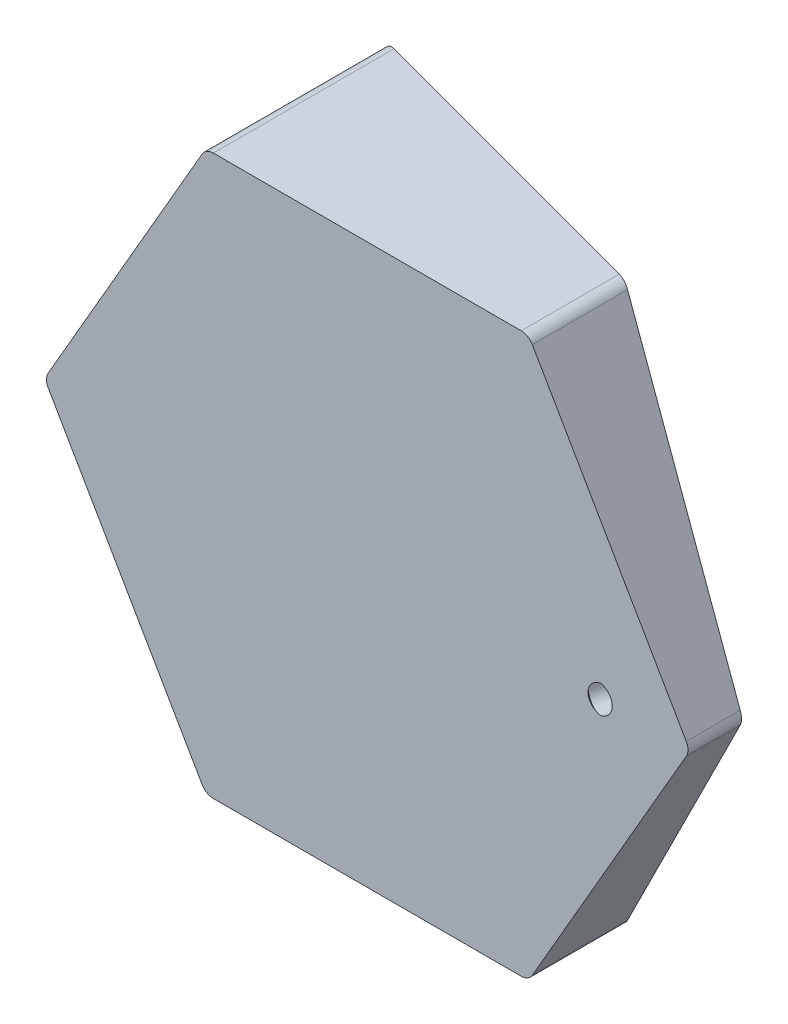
ISO-10303-21;
HEADER;
FILE_DESCRIPTION(('STEP AP214'),'2;1');
FILE_NAME('part.step','',(''),(''),'','','');
FILE_SCHEMA(('AUTOMOTIVE_DESIGN { 1 0 10303 214 1 1 1 1 }'));
ENDSEC;
DATA;
#1=APPLICATION_CONTEXT('core data for automotive mechanical design processes');
#2=APPLICATION_PROTOCOL_DEFINITION('international standard','automotive_design',2000,#1);
#3=PRODUCT_CONTEXT('',#1,'mechanical');
#4=PRODUCT('Part','Part','',(#3));
#5=PRODUCT_RELATED_PRODUCT_CATEGORY('part','',(#4));
#6=PRODUCT_DEFINITION_FORMATION('','',#4);
#7=PRODUCT_DEFINITION_CONTEXT('part definition',#1,'design');
#8=PRODUCT_DEFINITION('design','',#6,#7);
#9=PRODUCT_DEFINITION_SHAPE('','',#8);
#10=(LENGTH_UNIT() NAMED_UNIT(*) SI_UNIT(.MILLI.,.METRE.));
#11=(NAMED_UNIT(*) PLANE_ANGLE_UNIT() SI_UNIT($,.RADIAN.));
#12=(NAMED_UNIT(*) SI_UNIT($,.STERADIAN.) SOLID_ANGLE_UNIT());
#13=UNCERTAINTY_MEASURE_WITH_UNIT(LENGTH_MEASURE(1.E-05),#10,'distance_accuracy_value','');
#14=(GEOMETRIC_REPRESENTATION_CONTEXT(3) GLOBAL_UNCERTAINTY_ASSIGNED_CONTEXT((#13)) GLOBAL_UNIT_ASSIGNED_CONTEXT((#10,
#11,#12)) REPRESENTATION_CONTEXT('',''));
#15=CARTESIAN_POINT('',(0.,0.,0.));
#16=DIRECTION('',(0.,0.,1.));
#17=DIRECTION('',(1.,0.,0.));
#18=AXIS2_PLACEMENT_3D('',#15,#16,#17);
#19=CARTESIAN_POINT('',(25.0000000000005,-43.3012701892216,35.));
#20=DIRECTION('',(-0.866025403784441,0.499999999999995,0.));
#21=DIRECTION('',(-0.499999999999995,-0.866025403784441,0.));
#22=AXIS2_PLACEMENT_3D('',#19,#20,#21);
#23=PLANE('',#22);
#24=DIRECTION('',(0.499999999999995,0.866025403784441,0.));
#25=VECTOR('',#24,1.);
#26=CARTESIAN_POINT('',(25.0000000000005,-43.3012701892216,35.));
#27=LINE('',#26,#25);
#28=CARTESIAN_POINT('',(25.5773502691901,-42.3012701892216,35.));
#29=VERTEX_POINT('',#28);
#30=CARTESIAN_POINT('',(49.4226497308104,-1.,35.));
#31=VERTEX_POINT('',#30);
#32=EDGE_CURVE('E255',#29,#31,#27,.T.);
#33=ORIENTED_EDGE('',*,*,#32,.F.);
#34=DIRECTION('',(0.,0.,-1.));
#35=VECTOR('',#34,1.);
#36=CARTESIAN_POINT('',(25.5773502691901,-42.3012701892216,35.));
#37=LINE('',#36,#35);
#38=CARTESIAN_POINT('',(25.5773502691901,-42.3012701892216,20.250889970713));
#39=VERTEX_POINT('',#38);
#40=EDGE_CURVE('E178',#29,#39,#37,.T.);
#41=ORIENTED_EDGE('',*,*,#40,.T.);
#42=DIRECTION('',(0.495572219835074,0.858356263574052,0.132788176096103));
#43=VECTOR('',#42,1.);
#44=CARTESIAN_POINT('',(25.9807621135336,-41.6025403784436,20.358983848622));
#45=LINE('',#44,#43);
#46=CARTESIAN_POINT('',(49.4226497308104,-1.00000000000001,26.6402187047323));
#47=VERTEX_POINT('',#46);
#48=EDGE_CURVE('E252',#39,#47,#45,.T.);
#49=ORIENTED_EDGE('',*,*,#48,.T.);
#50=DIRECTION('',(0.,0.,-1.));
#51=VECTOR('',#50,1.);
#52=CARTESIAN_POINT('',(49.4226497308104,-1.,35.));
#53=LINE('',#52,#51);
#54=EDGE_CURVE('E242',#47,#31,#53,.F.);
#55=ORIENTED_EDGE('',*,*,#54,.T.);
#56=EDGE_LOOP('',(#33,#41,#49,#55));
#57=FACE_BOUND('',#56,.T.);
#58=ADVANCED_FACE('F45',(#57),#23,.F.);
#59=CARTESIAN_POINT('',(50.,0.,35.));
#60=DIRECTION('',(-0.866025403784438,-0.500000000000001,0.));
#61=DIRECTION('',(0.500000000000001,-0.866025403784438,0.));
#62=AXIS2_PLACEMENT_3D('',#59,#60,#61);
#63=PLANE('',#62);
#64=DIRECTION('',(-0.49557221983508,0.858356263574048,-0.132788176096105));
#65=VECTOR('',#64,1.);
#66=CARTESIAN_POINT('',(50.5399446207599,-0.935211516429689,26.9395969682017));
#67=LINE('',#66,#65);
#68=CARTESIAN_POINT('',(49.4226497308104,0.999999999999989,26.6402187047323));
#69=VERTEX_POINT('',#68);
#70=CARTESIAN_POINT('',(25.5773502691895,42.301270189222,20.2508899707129));
#71=VERTEX_POINT('',#70);
#72=EDGE_CURVE('E265',#69,#71,#67,.T.);
#73=ORIENTED_EDGE('',*,*,#72,.T.);
#74=DIRECTION('',(0.,0.,-1.));
#75=VECTOR('',#74,1.);
#76=CARTESIAN_POINT('',(25.5773502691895,42.301270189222,35.));
#77=LINE('',#76,#75);
#78=CARTESIAN_POINT('',(25.5773502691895,42.301270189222,35.));
#79=VERTEX_POINT('',#78);
#80=EDGE_CURVE('E221',#71,#79,#77,.F.);
#81=ORIENTED_EDGE('',*,*,#80,.T.);
#82=DIRECTION('',(-0.500000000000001,0.866025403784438,0.));
#83=VECTOR('',#82,1.);
#84=CARTESIAN_POINT('',(50.,0.,35.));
#85=LINE('',#84,#83);
#86=CARTESIAN_POINT('',(49.4226497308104,0.999999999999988,35.));
#87=VERTEX_POINT('',#86);
#88=EDGE_CURVE('E206',#87,#79,#85,.T.);
#89=ORIENTED_EDGE('',*,*,#88,.F.);
#90=DIRECTION('',(0.,0.,-1.));
#91=VECTOR('',#90,1.);
#92=CARTESIAN_POINT('',(49.4226497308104,0.999999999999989,35.));
#93=LINE('',#92,#91);
#94=EDGE_CURVE('E216',#87,#69,#93,.T.);
#95=ORIENTED_EDGE('',*,*,#94,.T.);
#96=EDGE_LOOP('',(#73,#81,#89,#95));
#97=FACE_BOUND('',#96,.T.);
#98=ADVANCED_FACE('F569',(#97),#63,.F.);
#99=CARTESIAN_POINT('',(24.9999999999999,43.301270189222,35.));
#100=DIRECTION('',(0.,-1.,0.));
#101=DIRECTION('',(1.,0.,0.));
#102=AXIS2_PLACEMENT_3D('',#99,#100,#101);
#103=PLANE('',#102);
#104=DIRECTION('',(0.96592582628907,0.,0.258819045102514));
#105=VECTOR('',#104,1.);
#106=CARTESIAN_POINT('',(-50.,43.301270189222,0.));
#107=LINE('',#106,#105);
#108=CARTESIAN_POINT('',(-23.8452994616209,43.301270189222,7.00813088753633));
#109=VERTEX_POINT('',#108);
#110=CARTESIAN_POINT('',(23.8452994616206,43.301270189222,19.7867883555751));
#111=VERTEX_POINT('',#110);
#112=EDGE_CURVE('E344',#109,#111,#107,.T.);
#113=ORIENTED_EDGE('',*,*,#112,.F.);
#114=DIRECTION('',(0.,0.,-1.));
#115=VECTOR('',#114,1.);
#116=CARTESIAN_POINT('',(-23.8452994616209,43.3012701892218,35.));
#117=LINE('',#116,#115);
#118=CARTESIAN_POINT('',(-23.8452994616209,43.3012701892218,35.));
#119=VERTEX_POINT('',#118);
#120=EDGE_CURVE('E212',#109,#119,#117,.F.);
#121=ORIENTED_EDGE('',*,*,#120,.T.);
#122=DIRECTION('',(-1.,0.,0.));
#123=VECTOR('',#122,1.);
#124=CARTESIAN_POINT('',(24.9999999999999,43.301270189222,35.));
#125=LINE('',#124,#123);
#126=CARTESIAN_POINT('',(23.8452994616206,43.301270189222,35.));
#127=VERTEX_POINT('',#126);
#128=EDGE_CURVE('E193',#127,#119,#125,.T.);
#129=ORIENTED_EDGE('',*,*,#128,.F.);
#130=DIRECTION('',(0.,0.,-1.));
#131=VECTOR('',#130,1.);
#132=CARTESIAN_POINT('',(23.8452994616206,43.301270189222,35.));
#133=LINE('',#132,#131);
#134=EDGE_CURVE('E307',#127,#111,#133,.T.);
#135=ORIENTED_EDGE('',*,*,#134,.T.);
#136=EDGE_LOOP('',(#113,#121,#129,#135));
#137=FACE_BOUND('',#136,.T.);
#138=ADVANCED_FACE('F574',(#137),#103,.F.);
#139=CARTESIAN_POINT('',(-25.0000000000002,43.3012701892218,35.));
#140=DIRECTION('',(0.866025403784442,-0.499999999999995,0.));
#141=DIRECTION('',(0.499999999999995,0.866025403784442,0.));
#142=AXIS2_PLACEMENT_3D('',#139,#140,#141);
#143=PLANE('',#142);
#144=DIRECTION('',(-0.499999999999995,-0.866025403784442,0.));
#145=VECTOR('',#144,1.);
#146=CARTESIAN_POINT('',(-25.0000000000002,43.3012701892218,35.));
#147=LINE('',#146,#145);
#148=CARTESIAN_POINT('',(-25.5773502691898,42.3012701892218,35.));
#149=VERTEX_POINT('',#148);
#150=CARTESIAN_POINT('',(-49.4226497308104,0.999999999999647,35.));
#151=VERTEX_POINT('',#150);
#152=EDGE_CURVE('E205',#149,#151,#147,.T.);
#153=ORIENTED_EDGE('',*,*,#152,.F.);
#154=DIRECTION('',(0.,0.,-1.));
#155=VECTOR('',#154,1.);
#156=CARTESIAN_POINT('',(-25.5773502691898,42.3012701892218,35.));
#157=LINE('',#156,#155);
#158=CARTESIAN_POINT('',(-25.5773502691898,42.3012701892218,6.54402927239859));
#159=VERTEX_POINT('',#158);
#160=EDGE_CURVE('E214',#149,#159,#157,.T.);
#161=ORIENTED_EDGE('',*,*,#160,.T.);
#162=DIRECTION('',(-0.495572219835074,-0.858356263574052,-0.132788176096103));
#163=VECTOR('',#162,1.);
#164=CARTESIAN_POINT('',(-23.1376029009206,46.5270365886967,7.19775760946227));
#165=LINE('',#164,#163);
#166=CARTESIAN_POINT('',(-49.4226497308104,0.99999999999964,0.154700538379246));
#167=VERTEX_POINT('',#166);
#168=EDGE_CURVE('E271',#159,#167,#165,.T.);
#169=ORIENTED_EDGE('',*,*,#168,.T.);
#170=DIRECTION('',(0.,0.,-1.));
#171=VECTOR('',#170,1.);
#172=CARTESIAN_POINT('',(-49.4226497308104,0.999999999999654,35.));
#173=LINE('',#172,#171);
#174=EDGE_CURVE('E286',#167,#151,#173,.F.);
#175=ORIENTED_EDGE('',*,*,#174,.T.);
#176=EDGE_LOOP('',(#153,#161,#169,#175));
#177=FACE_BOUND('',#176,.T.);
#178=ADVANCED_FACE('F336',(#177),#143,.F.);
#179=CARTESIAN_POINT('',(-50.,-3.49148133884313E-13,35.));
#180=DIRECTION('',(0.866025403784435,0.500000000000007,0.));
#181=DIRECTION('',(-0.500000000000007,0.866025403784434,0.));
#182=AXIS2_PLACEMENT_3D('',#179,#180,#181);
#183=PLANE('',#182);
#184=DIRECTION('',(0.500000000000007,-0.866025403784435,0.));
#185=VECTOR('',#184,1.);
#186=CARTESIAN_POINT('',(-50.,-3.49148133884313E-13,35.));
#187=LINE('',#186,#185);
#188=CARTESIAN_POINT('',(-49.4226497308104,-1.00000000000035,35.));
#189=VERTEX_POINT('',#188);
#190=CARTESIAN_POINT('',(-25.5773502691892,-42.3012701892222,35.));
#191=VERTEX_POINT('',#190);
#192=EDGE_CURVE('E279',#189,#191,#187,.T.);
#193=ORIENTED_EDGE('',*,*,#192,.F.);
#194=DIRECTION('',(0.,0.,-1.));
#195=VECTOR('',#194,1.);
#196=CARTESIAN_POINT('',(-49.4226497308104,-1.00000000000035,35.));
#197=LINE('',#196,#195);
#198=CARTESIAN_POINT('',(-49.4226497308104,-1.00000000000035,0.154700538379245));
#199=VERTEX_POINT('',#198);
#200=EDGE_CURVE('E232',#189,#199,#197,.T.);
#201=ORIENTED_EDGE('',*,*,#200,.T.);
#202=DIRECTION('',(0.495572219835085,-0.858356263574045,0.132788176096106));
#203=VECTOR('',#202,1.);
#204=CARTESIAN_POINT('',(-47.696785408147,-3.98928469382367,0.617144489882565));
#205=LINE('',#204,#203);
#206=CARTESIAN_POINT('',(-25.5773502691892,-42.3012701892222,6.54402927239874));
#207=VERTEX_POINT('',#206);
#208=EDGE_CURVE('E334',#199,#207,#205,.T.);
#209=ORIENTED_EDGE('',*,*,#208,.T.);
#210=DIRECTION('',(0.,0.,-1.));
#211=VECTOR('',#210,1.);
#212=CARTESIAN_POINT('',(-25.5773502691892,-42.3012701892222,35.));
#213=LINE('',#212,#211);
#214=EDGE_CURVE('E229',#207,#191,#213,.F.);
#215=ORIENTED_EDGE('',*,*,#214,.T.);
#216=EDGE_LOOP('',(#193,#201,#209,#215));
#217=FACE_BOUND('',#216,.T.);
#218=ADVANCED_FACE('F328',(#217),#183,.F.);
#219=CARTESIAN_POINT('',(-24.9999999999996,-43.3012701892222,35.));
#220=DIRECTION('',(0.,1.,0.));
#221=DIRECTION('',(-1.,0.,0.));
#222=AXIS2_PLACEMENT_3D('',#219,#220,#221);
#223=PLANE('',#222);
#224=DIRECTION('',(1.,0.,0.));
#225=VECTOR('',#224,1.);
#226=CARTESIAN_POINT('',(-24.9999999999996,-43.3012701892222,35.));
#227=LINE('',#226,#225);
#228=CARTESIAN_POINT('',(-23.8452994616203,-43.3012701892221,35.));
#229=VERTEX_POINT('',#228);
#230=CARTESIAN_POINT('',(23.8452994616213,-43.3012701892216,35.));
#231=VERTEX_POINT('',#230);
#232=EDGE_CURVE('E283',#229,#231,#227,.T.);
#233=ORIENTED_EDGE('',*,*,#232,.F.);
#234=DIRECTION('',(0.,0.,-1.));
#235=VECTOR('',#234,1.);
#236=CARTESIAN_POINT('',(-23.8452994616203,-43.3012701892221,35.));
#237=LINE('',#236,#235);
#238=CARTESIAN_POINT('',(-23.8452994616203,-43.3012701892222,7.00813088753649));
#239=VERTEX_POINT('',#238);
#240=EDGE_CURVE('E238',#229,#239,#237,.T.);
#241=ORIENTED_EDGE('',*,*,#240,.T.);
#242=DIRECTION('',(0.96592582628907,0.,0.258819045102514));
#243=VECTOR('',#242,1.);
#244=CARTESIAN_POINT('',(-50.,-43.3012701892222,0.));
#245=LINE('',#244,#243);
#246=CARTESIAN_POINT('',(23.8452994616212,-43.3012701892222,19.7867883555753));
#247=VERTEX_POINT('',#246);
#248=EDGE_CURVE('E339',#239,#247,#245,.T.);
#249=ORIENTED_EDGE('',*,*,#248,.T.);
#250=DIRECTION('',(0.,0.,-1.));
#251=VECTOR('',#250,1.);
#252=CARTESIAN_POINT('',(23.8452994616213,-43.3012701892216,35.));
#253=LINE('',#252,#251);
#254=EDGE_CURVE('E67',#247,#231,#253,.F.);
#255=ORIENTED_EDGE('',*,*,#254,.T.);
#256=EDGE_LOOP('',(#233,#241,#249,#255));
#257=FACE_BOUND('',#256,.T.);
#258=ADVANCED_FACE('F189',(#257),#223,.F.);
#259=CARTESIAN_POINT('',(0.,0.,35.));
#260=DIRECTION('',(0.,0.,1.));
#261=DIRECTION('',(1.,0.,0.));
#262=AXIS2_PLACEMENT_3D('',#259,#260,#261);
#263=PLANE('',#262);
#264=CARTESIAN_POINT('',(36.7786524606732,0.,35.));
#265=DIRECTION('',(0.,0.,1.));
#266=DIRECTION('',(1.,0.,0.));
#267=AXIS2_PLACEMENT_3D('',#264,#265,#266);
#268=ELLIPSE('',#267,2.59223756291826,2.24115320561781);
#269=CARTESIAN_POINT('',(36.189190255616,2.1824407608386,35.));
#270=VERTEX_POINT('',#269);
#271=CARTESIAN_POINT('',(36.189190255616,-2.1824407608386,35.));
#272=VERTEX_POINT('',#271);
#273=EDGE_CURVE('E11',#270,#272,#268,.T.);
#274=ORIENTED_EDGE('',*,*,#273,.F.);
#275=CARTESIAN_POINT('',(35.6226639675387,0.,35.));
#276=DIRECTION('',(0.,0.,1.));
#277=DIRECTION('',(1.,0.,0.));
#278=AXIS2_PLACEMENT_3D('',#275,#276,#277);
#279=ELLIPSE('',#278,2.32937140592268,2.25);
#280=EDGE_CURVE('E54',#272,#270,#279,.T.);
#281=ORIENTED_EDGE('',*,*,#280,.F.);
#282=EDGE_LOOP('',(#274,#281));
#283=FACE_BOUND('',#282,.T.);
#284=ORIENTED_EDGE('',*,*,#128,.T.);
#285=CARTESIAN_POINT('',(-23.8452994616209,41.3012701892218,35.));
#286=DIRECTION('',(0.,0.,1.));
#287=DIRECTION('',(1.,0.,0.));
#288=AXIS2_PLACEMENT_3D('',#285,#286,#287);
#289=CIRCLE('',#288,2.);
#290=EDGE_CURVE('E196',#119,#149,#289,.T.);
#291=ORIENTED_EDGE('',*,*,#290,.T.);
#292=ORIENTED_EDGE('',*,*,#152,.T.);
#293=CARTESIAN_POINT('',(-47.6905989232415,-3.33066907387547E-13,35.));
#294=DIRECTION('',(0.,0.,1.));
#295=DIRECTION('',(1.,0.,0.));
#296=AXIS2_PLACEMENT_3D('',#293,#294,#295);
#297=CIRCLE('',#296,2.);
#298=EDGE_CURVE('E223',#151,#189,#297,.T.);
#299=ORIENTED_EDGE('',*,*,#298,.T.);
#300=ORIENTED_EDGE('',*,*,#192,.T.);
#301=CARTESIAN_POINT('',(-23.8452994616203,-41.3012701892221,35.));
#302=DIRECTION('',(0.,0.,1.));
#303=DIRECTION('',(1.,0.,0.));
#304=AXIS2_PLACEMENT_3D('',#301,#302,#303);
#305=CIRCLE('',#304,2.);
#306=EDGE_CURVE('E318',#191,#229,#305,.T.);
#307=ORIENTED_EDGE('',*,*,#306,.T.);
#308=ORIENTED_EDGE('',*,*,#232,.T.);
#309=CARTESIAN_POINT('',(23.8452994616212,-41.3012701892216,35.));
#310=DIRECTION('',(0.,0.,1.));
#311=DIRECTION('',(1.,0.,0.));
#312=AXIS2_PLACEMENT_3D('',#309,#310,#311);
#313=CIRCLE('',#312,2.);
#314=EDGE_CURVE('E315',#231,#29,#313,.T.);
#315=ORIENTED_EDGE('',*,*,#314,.T.);
#316=ORIENTED_EDGE('',*,*,#32,.T.);
#317=CARTESIAN_POINT('',(47.6905989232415,0.,35.));
#318=DIRECTION('',(0.,0.,1.));
#319=DIRECTION('',(1.,0.,0.));
#320=AXIS2_PLACEMENT_3D('',#317,#318,#319);
#321=CIRCLE('',#320,2.);
#322=EDGE_CURVE('E312',#31,#87,#321,.T.);
#323=ORIENTED_EDGE('',*,*,#322,.T.);
#324=ORIENTED_EDGE('',*,*,#88,.T.);
#325=CARTESIAN_POINT('',(23.8452994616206,41.301270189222,35.));
#326=DIRECTION('',(0.,0.,1.));
#327=DIRECTION('',(1.,0.,0.));
#328=AXIS2_PLACEMENT_3D('',#325,#326,#327);
#329=CIRCLE('',#328,2.);
#330=EDGE_CURVE('E200',#79,#127,#329,.T.);
#331=ORIENTED_EDGE('',*,*,#330,.T.);
#332=EDGE_LOOP('',(#284,#291,#292,#299,#300,#307,#308,#315,#316,#323,#324,#331));
#333=FACE_BOUND('',#332,.T.);
#334=ADVANCED_FACE('F185',(#283,#333),#263,.T.);
#335=CARTESIAN_POINT('',(-50.,-43.3012701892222,0.));
#336=DIRECTION('',(-0.258819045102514,0.,0.96592582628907));
#337=DIRECTION('',(0.96592582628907,0.,0.258819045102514));
#338=AXIS2_PLACEMENT_3D('',#335,#336,#337);
#339=PLANE('',#338);
#340=CARTESIAN_POINT('',(38.637033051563,0.,23.7502214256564));
#341=DIRECTION('',(0.258819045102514,0.,-0.96592582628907));
#342=DIRECTION('',(-0.96592582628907,0.,-0.258819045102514));
#343=AXIS2_PLACEMENT_3D('',#340,#341,#342);
#344=CIRCLE('',#343,4.025);
#345=CARTESIAN_POINT('',(34.7491816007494,0.,22.7084747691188));
#346=VERTEX_POINT('',#345);
#347=EDGE_CURVE('E522',#346,#346,#344,.T.);
#348=ORIENTED_EDGE('',*,*,#347,.F.);
#349=EDGE_LOOP('',(#348));
#350=FACE_BOUND('',#349,.T.);
#351=CARTESIAN_POINT('',(1.50053580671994E-13,35.,13.3974596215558));
#352=DIRECTION('',(0.258819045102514,0.,-0.96592582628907));
#353=DIRECTION('',(-0.96592582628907,0.,-0.258819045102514));
#354=AXIS2_PLACEMENT_3D('',#351,#352,#353);
#355=CIRCLE('',#354,4.025);
#356=CARTESIAN_POINT('',(-3.88785145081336,35.,12.3557129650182));
#357=VERTEX_POINT('',#356);
#358=EDGE_CURVE('E182',#357,#357,#355,.T.);
#359=ORIENTED_EDGE('',*,*,#358,.F.);
#360=EDGE_LOOP('',(#359));
#361=FACE_BOUND('',#360,.T.);
#362=CARTESIAN_POINT('',(1.50053580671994E-13,-35.,13.3974596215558));
#363=DIRECTION('',(0.258819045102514,0.,-0.96592582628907));
#364=DIRECTION('',(-0.96592582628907,0.,-0.258819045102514));
#365=AXIS2_PLACEMENT_3D('',#362,#363,#364);
#366=CIRCLE('',#365,4.025);
#367=CARTESIAN_POINT('',(-3.88785145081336,-35.,12.3557129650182));
#368=VERTEX_POINT('',#367);
#369=EDGE_CURVE('E488',#368,#368,#366,.T.);
#370=ORIENTED_EDGE('',*,*,#369,.F.);
#371=EDGE_LOOP('',(#370));
#372=FACE_BOUND('',#371,.T.);
#373=CARTESIAN_POINT('',(-33.8074039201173,0.,4.33879304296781));
#374=DIRECTION('',(0.258819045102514,0.,-0.96592582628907));
#375=DIRECTION('',(-0.96592582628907,0.,-0.258819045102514));
#376=AXIS2_PLACEMENT_3D('',#373,#374,#375);
#377=CIRCLE('',#376,4.025);
#378=CARTESIAN_POINT('',(-37.6952553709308,0.,3.29704638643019));
#379=VERTEX_POINT('',#378);
#380=EDGE_CURVE('E468',#379,#379,#377,.T.);
#381=ORIENTED_EDGE('',*,*,#380,.F.);
#382=EDGE_LOOP('',(#381));
#383=FACE_BOUND('',#382,.T.);
#384=CARTESIAN_POINT('',(1.49619899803E-13,25.,13.3974596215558));
#385=DIRECTION('',(0.258819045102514,0.,-0.96592582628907));
#386=DIRECTION('',(-0.96592582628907,0.,-0.258819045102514));
#387=AXIS2_PLACEMENT_3D('',#384,#385,#386);
#388=CIRCLE('',#387,2.025);
#389=CARTESIAN_POINT('',(-1.95599979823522,25.,12.8733510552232));
#390=VERTEX_POINT('',#389);
#391=EDGE_CURVE('E448',#390,#390,#388,.T.);
#392=ORIENTED_EDGE('',*,*,#391,.F.);
#393=EDGE_LOOP('',(#392));
#394=FACE_BOUND('',#393,.T.);
#395=CARTESIAN_POINT('',(-17.0753175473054,17.6776695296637,8.82214207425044));
#396=DIRECTION('',(0.258819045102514,0.,-0.96592582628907));
#397=DIRECTION('',(-0.96592582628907,0.,-0.258819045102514));
#398=AXIS2_PLACEMENT_3D('',#395,#396,#397);
#399=CIRCLE('',#398,2.025);
#400=CARTESIAN_POINT('',(-19.0313173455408,17.6776695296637,8.29803350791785));
#401=VERTEX_POINT('',#400);
#402=EDGE_CURVE('E436',#401,#401,#399,.T.);
#403=ORIENTED_EDGE('',*,*,#402,.F.);
#404=EDGE_LOOP('',(#403));
#405=FACE_BOUND('',#404,.T.);
#406=CARTESIAN_POINT('',(-24.1481456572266,0.,6.92698349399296));
#407=DIRECTION('',(0.258819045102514,0.,-0.96592582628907));
#408=DIRECTION('',(-0.96592582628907,0.,-0.258819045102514));
#409=AXIS2_PLACEMENT_3D('',#406,#407,#408);
#410=CIRCLE('',#409,2.025);
#411=CARTESIAN_POINT('',(-26.104145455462,0.,6.40287492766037));
#412=VERTEX_POINT('',#411);
#413=EDGE_CURVE('E424',#412,#412,#410,.T.);
#414=ORIENTED_EDGE('',*,*,#413,.F.);
#415=EDGE_LOOP('',(#414));
#416=FACE_BOUND('',#415,.T.);
#417=CARTESIAN_POINT('',(-17.0753175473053,-17.6776695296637,8.82214207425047));
#418=DIRECTION('',(0.258819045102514,0.,-0.96592582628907));
#419=DIRECTION('',(-0.96592582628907,0.,-0.258819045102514));
#420=AXIS2_PLACEMENT_3D('',#417,#418,#419);
#421=CIRCLE('',#420,2.025);
#422=CARTESIAN_POINT('',(-19.0313173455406,-17.6776695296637,8.29803350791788));
#423=VERTEX_POINT('',#422);
#424=EDGE_CURVE('E412',#423,#423,#421,.T.);
#425=ORIENTED_EDGE('',*,*,#424,.F.);
#426=EDGE_LOOP('',(#425));
#427=FACE_BOUND('',#426,.T.);
#428=CARTESIAN_POINT('',(3.19622800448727E-13,-25.,13.3974596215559));
#429=DIRECTION('',(0.258819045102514,0.,-0.96592582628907));
#430=DIRECTION('',(-0.96592582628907,0.,-0.258819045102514));
#431=AXIS2_PLACEMENT_3D('',#428,#429,#430);
#432=CIRCLE('',#431,2.025);
#433=CARTESIAN_POINT('',(-1.95599979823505,-25.,12.8733510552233));
#434=VERTEX_POINT('',#433);
#435=EDGE_CURVE('E400',#434,#434,#432,.T.);
#436=ORIENTED_EDGE('',*,*,#435,.F.);
#437=EDGE_LOOP('',(#436));
#438=FACE_BOUND('',#437,.T.);
#439=CARTESIAN_POINT('',(17.0753175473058,-17.6776695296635,17.9727771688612));
#440=DIRECTION('',(0.258819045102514,0.,-0.96592582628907));
#441=DIRECTION('',(-0.96592582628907,0.,-0.258819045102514));
#442=AXIS2_PLACEMENT_3D('',#439,#440,#441);
#443=CIRCLE('',#442,2.025);
#444=CARTESIAN_POINT('',(15.1193177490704,-17.6776695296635,17.4486686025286));
#445=VERTEX_POINT('',#444);
#446=EDGE_CURVE('E388',#445,#445,#443,.T.);
#447=ORIENTED_EDGE('',*,*,#446,.F.);
#448=EDGE_LOOP('',(#447));
#449=FACE_BOUND('',#448,.T.);
#450=CARTESIAN_POINT('',(24.1481456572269,3.07913416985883E-13,19.8679357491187));
#451=DIRECTION('',(0.258819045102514,0.,-0.96592582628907));
#452=DIRECTION('',(-0.96592582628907,0.,-0.258819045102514));
#453=AXIS2_PLACEMENT_3D('',#450,#451,#452);
#454=CIRCLE('',#453,2.025);
#455=CARTESIAN_POINT('',(22.1921458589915,3.07913416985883E-13,19.3438271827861));
#456=VERTEX_POINT('',#455);
#457=EDGE_CURVE('E376',#456,#456,#454,.T.);
#458=ORIENTED_EDGE('',*,*,#457,.F.);
#459=EDGE_LOOP('',(#458));
#460=FACE_BOUND('',#459,.T.);
#461=CARTESIAN_POINT('',(17.0753175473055,17.677669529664,17.9727771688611));
#462=DIRECTION('',(0.258819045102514,0.,-0.96592582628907));
#463=DIRECTION('',(-0.96592582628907,0.,-0.258819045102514));
#464=AXIS2_PLACEMENT_3D('',#461,#462,#463);
#465=CIRCLE('',#464,2.025);
#466=CARTESIAN_POINT('',(15.1193177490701,17.677669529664,17.4486686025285));
#467=VERTEX_POINT('',#466);
#468=EDGE_CURVE('E364',#467,#467,#465,.T.);
#469=ORIENTED_EDGE('',*,*,#468,.F.);
#470=EDGE_LOOP('',(#469));
#471=FACE_BOUND('',#470,.T.);
#472=CARTESIAN_POINT('',(1.50487261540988E-13,0.,13.3974596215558));
#473=DIRECTION('',(0.258819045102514,0.,-0.96592582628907));
#474=DIRECTION('',(-0.96592582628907,0.,-0.258819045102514));
#475=AXIS2_PLACEMENT_3D('',#472,#473,#474);
#476=CIRCLE('',#475,17.5);
#477=CARTESIAN_POINT('',(-16.9037019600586,0.,8.86812633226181));
#478=VERTEX_POINT('',#477);
#479=EDGE_CURVE('E349',#478,#478,#476,.T.);
#480=ORIENTED_EDGE('',*,*,#479,.F.);
#481=EDGE_LOOP('',(#480));
#482=FACE_BOUND('',#481,.T.);
#483=ORIENTED_EDGE('',*,*,#168,.F.);
#484=CARTESIAN_POINT('',(-23.8452994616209,41.3012701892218,7.00813088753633));
#485=DIRECTION('',(-0.258819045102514,0.,0.96592582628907));
#486=DIRECTION('',(-0.96592582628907,0.,-0.258819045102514));
#487=AXIS2_PLACEMENT_3D('',#484,#485,#486);
#488=ELLIPSE('',#487,2.07055236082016,2.);
#489=EDGE_CURVE('E304',#159,#109,#488,.F.);
#490=ORIENTED_EDGE('',*,*,#489,.T.);
#491=ORIENTED_EDGE('',*,*,#112,.T.);
#492=CARTESIAN_POINT('',(23.8452994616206,41.301270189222,19.7867883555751));
#493=DIRECTION('',(-0.258819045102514,0.,0.96592582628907));
#494=DIRECTION('',(-0.96592582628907,0.,-0.258819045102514));
#495=AXIS2_PLACEMENT_3D('',#492,#493,#494);
#496=ELLIPSE('',#495,2.07055236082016,2.);
#497=EDGE_CURVE('E301',#111,#71,#496,.F.);
#498=ORIENTED_EDGE('',*,*,#497,.T.);
#499=ORIENTED_EDGE('',*,*,#72,.F.);
#500=CARTESIAN_POINT('',(47.6905989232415,0.,26.1761170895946));
#501=DIRECTION('',(-0.258819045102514,0.,0.96592582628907));
#502=DIRECTION('',(-0.96592582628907,0.,-0.258819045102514));
#503=AXIS2_PLACEMENT_3D('',#500,#501,#502);
#504=ELLIPSE('',#503,2.07055236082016,2.);
#505=EDGE_CURVE('E263',#69,#47,#504,.F.);
#506=ORIENTED_EDGE('',*,*,#505,.T.);
#507=ORIENTED_EDGE('',*,*,#48,.F.);
#508=CARTESIAN_POINT('',(23.8452994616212,-41.3012701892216,19.7867883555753));
#509=DIRECTION('',(-0.258819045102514,0.,0.96592582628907));
#510=DIRECTION('',(-0.96592582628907,0.,-0.258819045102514));
#511=AXIS2_PLACEMENT_3D('',#508,#509,#510);
#512=ELLIPSE('',#511,2.07055236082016,2.);
#513=EDGE_CURVE('E261',#39,#247,#512,.F.);
#514=ORIENTED_EDGE('',*,*,#513,.T.);
#515=ORIENTED_EDGE('',*,*,#248,.F.);
#516=CARTESIAN_POINT('',(-23.8452994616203,-41.3012701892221,7.00813088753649));
#517=DIRECTION('',(-0.258819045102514,0.,0.96592582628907));
#518=DIRECTION('',(-0.96592582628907,0.,-0.258819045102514));
#519=AXIS2_PLACEMENT_3D('',#516,#517,#518);
#520=ELLIPSE('',#519,2.07055236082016,2.);
#521=EDGE_CURVE('E295',#239,#207,#520,.F.);
#522=ORIENTED_EDGE('',*,*,#521,.T.);
#523=ORIENTED_EDGE('',*,*,#208,.F.);
#524=CARTESIAN_POINT('',(-47.6905989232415,-3.33066907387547E-13,0.618802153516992));
#525=DIRECTION('',(-0.258819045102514,0.,0.96592582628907));
#526=DIRECTION('',(-0.96592582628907,0.,-0.258819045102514));
#527=AXIS2_PLACEMENT_3D('',#524,#525,#526);
#528=ELLIPSE('',#527,2.07055236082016,2.);
#529=EDGE_CURVE('E298',#199,#167,#528,.F.);
#530=ORIENTED_EDGE('',*,*,#529,.T.);
#531=EDGE_LOOP('',(#483,#490,#491,#498,#499,#506,#507,#514,#515,#522,#523,#530));
#532=FACE_BOUND('',#531,.T.);
#533=ADVANCED_FACE('F188',(#350,#361,#372,#383,#394,#405,#416,#427,#438,#449,#460,#471,#482,
#532),#339,.F.);
#534=CARTESIAN_POINT('',(-1.55291427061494,0.,19.1930145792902));
#535=DIRECTION('',(0.258819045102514,0.,-0.96592582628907));
#536=DIRECTION('',(-0.96592582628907,0.,-0.258819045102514));
#537=AXIS2_PLACEMENT_3D('',#534,#535,#536);
#538=CYLINDRICAL_SURFACE('',#537,17.5);
#539=CARTESIAN_POINT('',(-1.55291427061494,0.,19.1930145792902));
#540=DIRECTION('',(0.258819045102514,0.,-0.96592582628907));
#541=DIRECTION('',(-0.96592582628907,0.,-0.258819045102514));
#542=AXIS2_PLACEMENT_3D('',#539,#540,#541);
#543=CIRCLE('',#542,17.5);
#544=CARTESIAN_POINT('',(-18.4566162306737,0.,14.6636812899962));
#545=VERTEX_POINT('',#544);
#546=EDGE_CURVE('E348',#545,#545,#543,.T.);
#547=ORIENTED_EDGE('',*,*,#546,.F.);
#548=EDGE_LOOP('',(#547));
#549=FACE_BOUND('',#548,.T.);
#550=ORIENTED_EDGE('',*,*,#479,.T.);
#551=EDGE_LOOP('',(#550));
#552=FACE_BOUND('',#551,.T.);
#553=ADVANCED_FACE('F531',(#549,#552),#538,.F.);
#554=CARTESIAN_POINT('',(-1.55291427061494,0.,19.1930145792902));
#555=DIRECTION('',(0.258819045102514,0.,-0.96592582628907));
#556=DIRECTION('',(-0.96592582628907,0.,-0.258819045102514));
#557=AXIS2_PLACEMENT_3D('',#554,#555,#556);
#558=PLANE('',#557);
#559=ORIENTED_EDGE('',*,*,#546,.T.);
#560=EDGE_LOOP('',(#559));
#561=FACE_BOUND('',#560,.T.);
#562=ADVANCED_FACE('F558',(#561),#558,.T.);
#563=CARTESIAN_POINT('',(14.0988985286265,17.677669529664,29.0809241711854));
#564=DIRECTION('',(0.258819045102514,0.,-0.96592582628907));
#565=DIRECTION('',(-0.96592582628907,0.,-0.258819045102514));
#566=AXIS2_PLACEMENT_3D('',#563,#564,#565);
#567=CONICAL_SURFACE('',#566,1.65,1.02974425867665);
#568=CARTESIAN_POINT('',(13.8423001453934,17.6776695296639,30.0385623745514));
#569=VERTEX_POINT('',#568);
#570=VERTEX_LOOP('',#569);
#571=FACE_BOUND('',#570,.T.);
#572=CARTESIAN_POINT('',(14.0988985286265,17.677669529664,29.0809241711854));
#573=DIRECTION('',(0.258819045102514,0.,-0.96592582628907));
#574=DIRECTION('',(-0.96592582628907,0.,-0.258819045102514));
#575=AXIS2_PLACEMENT_3D('',#572,#573,#574);
#576=CIRCLE('',#575,1.65);
#577=CARTESIAN_POINT('',(12.5051209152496,17.677669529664,28.6538727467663));
#578=VERTEX_POINT('',#577);
#579=EDGE_CURVE('E353',#578,#578,#576,.T.);
#580=ORIENTED_EDGE('',*,*,#579,.T.);
#581=EDGE_LOOP('',(#580));
#582=FACE_BOUND('',#581,.T.);
#583=ADVANCED_FACE('F564',(#571,#582),#567,.F.);
#584=CARTESIAN_POINT('',(17.0753175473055,17.677669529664,17.9727771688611));
#585=DIRECTION('',(0.258819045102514,0.,-0.96592582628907));
#586=DIRECTION('',(-0.96592582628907,0.,-0.258819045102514));
#587=AXIS2_PLACEMENT_3D('',#584,#585,#586);
#588=CYLINDRICAL_SURFACE('',#587,1.65);
#589=ORIENTED_EDGE('',*,*,#579,.F.);
#590=EDGE_LOOP('',(#589));
#591=FACE_BOUND('',#590,.T.);
#592=CARTESIAN_POINT('',(16.978260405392,17.677669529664,18.3349993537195));
#593=DIRECTION('',(0.258819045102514,0.,-0.96592582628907));
#594=DIRECTION('',(-0.96592582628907,0.,-0.258819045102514));
#595=AXIS2_PLACEMENT_3D('',#592,#593,#594);
#596=CIRCLE('',#595,1.65);
#597=CARTESIAN_POINT('',(15.384482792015,17.677669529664,17.9079479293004));
#598=VERTEX_POINT('',#597);
#599=EDGE_CURVE('E360',#598,#598,#596,.T.);
#600=ORIENTED_EDGE('',*,*,#599,.T.);
#601=EDGE_LOOP('',(#600));
#602=FACE_BOUND('',#601,.T.);
#603=ADVANCED_FACE('F964',(#591,#602),#588,.F.);
#604=CARTESIAN_POINT('',(17.0753175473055,17.677669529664,17.9727771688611));
#605=DIRECTION('',(0.258819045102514,0.,-0.96592582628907));
#606=DIRECTION('',(-0.96592582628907,0.,-0.258819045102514));
#607=AXIS2_PLACEMENT_3D('',#604,#605,#606);
#608=CONICAL_SURFACE('',#607,2.025,0.785398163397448);
#609=ORIENTED_EDGE('',*,*,#599,.F.);
#610=EDGE_LOOP('',(#609));
#611=FACE_BOUND('',#610,.T.);
#612=ORIENTED_EDGE('',*,*,#468,.T.);
#613=EDGE_LOOP('',(#612));
#614=FACE_BOUND('',#613,.T.);
#615=ADVANCED_FACE('F960',(#611,#614),#608,.F.);
#616=CARTESIAN_POINT('',(21.171726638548,3.07913416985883E-13,30.976082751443));
#617=DIRECTION('',(0.258819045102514,0.,-0.96592582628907));
#618=DIRECTION('',(-0.96592582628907,0.,-0.258819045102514));
#619=AXIS2_PLACEMENT_3D('',#616,#617,#618);
#620=CONICAL_SURFACE('',#619,1.65,1.02974425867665);
#621=CARTESIAN_POINT('',(20.9151282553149,3.04853901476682E-13,31.9337209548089));
#622=VERTEX_POINT('',#621);
#623=VERTEX_LOOP('',#622);
#624=FACE_BOUND('',#623,.T.);
#625=CARTESIAN_POINT('',(21.171726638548,3.07913416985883E-13,30.976082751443));
#626=DIRECTION('',(0.258819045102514,0.,-0.96592582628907));
#627=DIRECTION('',(-0.96592582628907,0.,-0.258819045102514));
#628=AXIS2_PLACEMENT_3D('',#625,#626,#627);
#629=CIRCLE('',#628,1.65);
#630=CARTESIAN_POINT('',(19.577949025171,3.07913416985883E-13,30.5490313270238));
#631=VERTEX_POINT('',#630);
#632=EDGE_CURVE('E368',#631,#631,#629,.T.);
#633=ORIENTED_EDGE('',*,*,#632,.T.);
#634=EDGE_LOOP('',(#633));
#635=FACE_BOUND('',#634,.T.);
#636=ADVANCED_FACE('F956',(#624,#635),#620,.F.);
#637=CARTESIAN_POINT('',(24.1481456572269,3.07913416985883E-13,19.8679357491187));
#638=DIRECTION('',(0.258819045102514,0.,-0.96592582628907));
#639=DIRECTION('',(-0.96592582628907,0.,-0.258819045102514));
#640=AXIS2_PLACEMENT_3D('',#637,#638,#639);
#641=CYLINDRICAL_SURFACE('',#640,1.65);
#642=ORIENTED_EDGE('',*,*,#632,.F.);
#643=EDGE_LOOP('',(#642));
#644=FACE_BOUND('',#643,.T.);
#645=CARTESIAN_POINT('',(24.0510885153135,3.07913416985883E-13,20.2301579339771));
#646=DIRECTION('',(0.258819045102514,0.,-0.96592582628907));
#647=DIRECTION('',(-0.96592582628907,0.,-0.258819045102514));
#648=AXIS2_PLACEMENT_3D('',#645,#646,#647);
#649=CIRCLE('',#648,1.65);
#650=CARTESIAN_POINT('',(22.4573109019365,3.07913416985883E-13,19.8031065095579));
#651=VERTEX_POINT('',#650);
#652=EDGE_CURVE('E372',#651,#651,#649,.T.);
#653=ORIENTED_EDGE('',*,*,#652,.T.);
#654=EDGE_LOOP('',(#653));
#655=FACE_BOUND('',#654,.T.);
#656=ADVANCED_FACE('F952',(#644,#655),#641,.F.);
#657=CARTESIAN_POINT('',(24.1481456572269,3.07913416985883E-13,19.8679357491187));
#658=DIRECTION('',(0.258819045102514,0.,-0.96592582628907));
#659=DIRECTION('',(-0.96592582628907,0.,-0.258819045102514));
#660=AXIS2_PLACEMENT_3D('',#657,#658,#659);
#661=CONICAL_SURFACE('',#660,2.025,0.785398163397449);
#662=ORIENTED_EDGE('',*,*,#652,.F.);
#663=EDGE_LOOP('',(#662));
#664=FACE_BOUND('',#663,.T.);
#665=ORIENTED_EDGE('',*,*,#457,.T.);
#666=EDGE_LOOP('',(#665));
#667=FACE_BOUND('',#666,.T.);
#668=ADVANCED_FACE('F948',(#664,#667),#661,.F.);
#669=CARTESIAN_POINT('',(14.0988985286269,-17.6776695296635,29.0809241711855));
#670=DIRECTION('',(0.258819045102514,0.,-0.96592582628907));
#671=DIRECTION('',(-0.96592582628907,0.,-0.258819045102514));
#672=AXIS2_PLACEMENT_3D('',#669,#670,#671);
#673=CONICAL_SURFACE('',#672,1.65,1.02974425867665);
#674=CARTESIAN_POINT('',(13.8423001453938,-17.6776695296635,30.0385623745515));
#675=VERTEX_POINT('',#674);
#676=VERTEX_LOOP('',#675);
#677=FACE_BOUND('',#676,.T.);
#678=CARTESIAN_POINT('',(14.0988985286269,-17.6776695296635,29.0809241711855));
#679=DIRECTION('',(0.258819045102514,0.,-0.96592582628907));
#680=DIRECTION('',(-0.96592582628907,0.,-0.258819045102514));
#681=AXIS2_PLACEMENT_3D('',#678,#679,#680);
#682=CIRCLE('',#681,1.65);
#683=CARTESIAN_POINT('',(12.5051209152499,-17.6776695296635,28.6538727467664));
#684=VERTEX_POINT('',#683);
#685=EDGE_CURVE('E380',#684,#684,#682,.T.);
#686=ORIENTED_EDGE('',*,*,#685,.T.);
#687=EDGE_LOOP('',(#686));
#688=FACE_BOUND('',#687,.T.);
#689=ADVANCED_FACE('F944',(#677,#688),#673,.F.);
#690=CARTESIAN_POINT('',(17.0753175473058,-17.6776695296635,17.9727771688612));
#691=DIRECTION('',(0.258819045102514,0.,-0.96592582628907));
#692=DIRECTION('',(-0.96592582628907,0.,-0.258819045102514));
#693=AXIS2_PLACEMENT_3D('',#690,#691,#692);
#694=CYLINDRICAL_SURFACE('',#693,1.65);
#695=ORIENTED_EDGE('',*,*,#685,.F.);
#696=EDGE_LOOP('',(#695));
#697=FACE_BOUND('',#696,.T.);
#698=CARTESIAN_POINT('',(16.9782604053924,-17.6776695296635,18.3349993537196));
#699=DIRECTION('',(0.258819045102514,0.,-0.96592582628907));
#700=DIRECTION('',(-0.96592582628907,0.,-0.258819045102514));
#701=AXIS2_PLACEMENT_3D('',#698,#699,#700);
#702=CIRCLE('',#701,1.65);
#703=CARTESIAN_POINT('',(15.3844827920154,-17.6776695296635,17.9079479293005));
#704=VERTEX_POINT('',#703);
#705=EDGE_CURVE('E384',#704,#704,#702,.T.);
#706=ORIENTED_EDGE('',*,*,#705,.T.);
#707=EDGE_LOOP('',(#706));
#708=FACE_BOUND('',#707,.T.);
#709=ADVANCED_FACE('F940',(#697,#708),#694,.F.);
#710=CARTESIAN_POINT('',(17.0753175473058,-17.6776695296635,17.9727771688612));
#711=DIRECTION('',(0.258819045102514,0.,-0.96592582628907));
#712=DIRECTION('',(-0.96592582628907,0.,-0.258819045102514));
#713=AXIS2_PLACEMENT_3D('',#710,#711,#712);
#714=CONICAL_SURFACE('',#713,2.025,0.785398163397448);
#715=ORIENTED_EDGE('',*,*,#705,.F.);
#716=EDGE_LOOP('',(#715));
#717=FACE_BOUND('',#716,.T.);
#718=ORIENTED_EDGE('',*,*,#446,.T.);
#719=EDGE_LOOP('',(#718));
#720=FACE_BOUND('',#719,.T.);
#721=ADVANCED_FACE('F936',(#717,#720),#714,.F.);
#722=CARTESIAN_POINT('',(-2.9764190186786,-25.,24.5056066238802));
#723=DIRECTION('',(0.258819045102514,0.,-0.96592582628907));
#724=DIRECTION('',(-0.96592582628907,0.,-0.258819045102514));
#725=AXIS2_PLACEMENT_3D('',#722,#723,#724);
#726=CONICAL_SURFACE('',#725,1.65,1.02974425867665);
#727=CARTESIAN_POINT('',(-3.23301740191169,-25.,25.4632448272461));
#728=VERTEX_POINT('',#727);
#729=VERTEX_LOOP('',#728);
#730=FACE_BOUND('',#729,.T.);
#731=CARTESIAN_POINT('',(-2.9764190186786,-25.,24.5056066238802));
#732=DIRECTION('',(0.258819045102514,0.,-0.96592582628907));
#733=DIRECTION('',(-0.96592582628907,0.,-0.258819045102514));
#734=AXIS2_PLACEMENT_3D('',#731,#732,#733);
#735=CIRCLE('',#734,1.65);
#736=CARTESIAN_POINT('',(-4.57019663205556,-25.,24.078555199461));
#737=VERTEX_POINT('',#736);
#738=EDGE_CURVE('E392',#737,#737,#735,.T.);
#739=ORIENTED_EDGE('',*,*,#738,.T.);
#740=EDGE_LOOP('',(#739));
#741=FACE_BOUND('',#740,.T.);
#742=ADVANCED_FACE('F932',(#730,#741),#726,.F.);
#743=CARTESIAN_POINT('',(3.19622800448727E-13,-25.,13.3974596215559));
#744=DIRECTION('',(0.258819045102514,0.,-0.96592582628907));
#745=DIRECTION('',(-0.96592582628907,0.,-0.258819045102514));
#746=AXIS2_PLACEMENT_3D('',#743,#744,#745);
#747=CYLINDRICAL_SURFACE('',#746,1.65);
#748=ORIENTED_EDGE('',*,*,#738,.F.);
#749=EDGE_LOOP('',(#748));
#750=FACE_BOUND('',#749,.T.);
#751=CARTESIAN_POINT('',(-0.0970571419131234,-25.,13.7596818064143));
#752=DIRECTION('',(0.258819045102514,0.,-0.96592582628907));
#753=DIRECTION('',(-0.96592582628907,0.,-0.258819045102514));
#754=AXIS2_PLACEMENT_3D('',#751,#752,#753);
#755=CIRCLE('',#754,1.65);
#756=CARTESIAN_POINT('',(-1.69083475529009,-25.,13.3326303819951));
#757=VERTEX_POINT('',#756);
#758=EDGE_CURVE('E396',#757,#757,#755,.T.);
#759=ORIENTED_EDGE('',*,*,#758,.T.);
#760=EDGE_LOOP('',(#759));
#761=FACE_BOUND('',#760,.T.);
#762=ADVANCED_FACE('F928',(#750,#761),#747,.F.);
#763=CARTESIAN_POINT('',(3.19622800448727E-13,-25.,13.3974596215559));
#764=DIRECTION('',(0.258819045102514,0.,-0.96592582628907));
#765=DIRECTION('',(-0.96592582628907,0.,-0.258819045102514));
#766=AXIS2_PLACEMENT_3D('',#763,#764,#765);
#767=CONICAL_SURFACE('',#766,2.025,0.785398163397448);
#768=ORIENTED_EDGE('',*,*,#758,.F.);
#769=EDGE_LOOP('',(#768));
#770=FACE_BOUND('',#769,.T.);
#771=ORIENTED_EDGE('',*,*,#435,.T.);
#772=EDGE_LOOP('',(#771));
#773=FACE_BOUND('',#772,.T.);
#774=ADVANCED_FACE('F924',(#770,#773),#767,.F.);
#775=CARTESIAN_POINT('',(-20.0517365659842,-17.6776695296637,19.9302890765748));
#776=DIRECTION('',(0.258819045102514,0.,-0.96592582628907));
#777=DIRECTION('',(-0.96592582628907,0.,-0.258819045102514));
#778=AXIS2_PLACEMENT_3D('',#775,#776,#777);
#779=CONICAL_SURFACE('',#778,1.65,1.02974425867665);
#780=CARTESIAN_POINT('',(-20.3083349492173,-17.6776695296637,20.8879272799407));
#781=VERTEX_POINT('',#780);
#782=VERTEX_LOOP('',#781);
#783=FACE_BOUND('',#782,.T.);
#784=CARTESIAN_POINT('',(-20.0517365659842,-17.6776695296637,19.9302890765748));
#785=DIRECTION('',(0.258819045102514,0.,-0.96592582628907));
#786=DIRECTION('',(-0.96592582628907,0.,-0.258819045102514));
#787=AXIS2_PLACEMENT_3D('',#784,#785,#786);
#788=CIRCLE('',#787,1.65);
#789=CARTESIAN_POINT('',(-21.6455141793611,-17.6776695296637,19.5032376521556));
#790=VERTEX_POINT('',#789);
#791=EDGE_CURVE('E404',#790,#790,#788,.T.);
#792=ORIENTED_EDGE('',*,*,#791,.T.);
#793=EDGE_LOOP('',(#792));
#794=FACE_BOUND('',#793,.T.);
#795=ADVANCED_FACE('F920',(#783,#794),#779,.F.);
#796=CARTESIAN_POINT('',(-17.0753175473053,-17.6776695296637,8.82214207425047));
#797=DIRECTION('',(0.258819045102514,0.,-0.96592582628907));
#798=DIRECTION('',(-0.96592582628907,0.,-0.258819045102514));
#799=AXIS2_PLACEMENT_3D('',#796,#797,#798);
#800=CYLINDRICAL_SURFACE('',#799,1.65);
#801=ORIENTED_EDGE('',*,*,#791,.F.);
#802=EDGE_LOOP('',(#801));
#803=FACE_BOUND('',#802,.T.);
#804=CARTESIAN_POINT('',(-17.1723746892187,-17.6776695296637,9.18436425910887));
#805=DIRECTION('',(0.258819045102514,0.,-0.96592582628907));
#806=DIRECTION('',(-0.96592582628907,0.,-0.258819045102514));
#807=AXIS2_PLACEMENT_3D('',#804,#805,#806);
#808=CIRCLE('',#807,1.65);
#809=CARTESIAN_POINT('',(-18.7661523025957,-17.6776695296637,8.75731283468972));
#810=VERTEX_POINT('',#809);
#811=EDGE_CURVE('E408',#810,#810,#808,.T.);
#812=ORIENTED_EDGE('',*,*,#811,.T.);
#813=EDGE_LOOP('',(#812));
#814=FACE_BOUND('',#813,.T.);
#815=ADVANCED_FACE('F916',(#803,#814),#800,.F.);
#816=CARTESIAN_POINT('',(-17.0753175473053,-17.6776695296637,8.82214207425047));
#817=DIRECTION('',(0.258819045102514,0.,-0.96592582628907));
#818=DIRECTION('',(-0.96592582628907,0.,-0.258819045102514));
#819=AXIS2_PLACEMENT_3D('',#816,#817,#818);
#820=CONICAL_SURFACE('',#819,2.025,0.785398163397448);
#821=ORIENTED_EDGE('',*,*,#811,.F.);
#822=EDGE_LOOP('',(#821));
#823=FACE_BOUND('',#822,.T.);
#824=ORIENTED_EDGE('',*,*,#424,.T.);
#825=EDGE_LOOP('',(#824));
#826=FACE_BOUND('',#825,.T.);
#827=ADVANCED_FACE('F912',(#823,#826),#820,.F.);
#828=CARTESIAN_POINT('',(-27.1245646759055,0.,18.0351304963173));
#829=DIRECTION('',(0.258819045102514,0.,-0.96592582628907));
#830=DIRECTION('',(-0.96592582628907,0.,-0.258819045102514));
#831=AXIS2_PLACEMENT_3D('',#828,#829,#830);
#832=CONICAL_SURFACE('',#831,1.65,1.02974425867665);
#833=CARTESIAN_POINT('',(-27.3811630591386,0.,18.9927686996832));
#834=VERTEX_POINT('',#833);
#835=VERTEX_LOOP('',#834);
#836=FACE_BOUND('',#835,.T.);
#837=CARTESIAN_POINT('',(-27.1245646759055,0.,18.0351304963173));
#838=DIRECTION('',(0.258819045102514,0.,-0.96592582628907));
#839=DIRECTION('',(-0.96592582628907,0.,-0.258819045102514));
#840=AXIS2_PLACEMENT_3D('',#837,#838,#839);
#841=CIRCLE('',#840,1.65);
#842=CARTESIAN_POINT('',(-28.7183422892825,0.,17.6080790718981));
#843=VERTEX_POINT('',#842);
#844=EDGE_CURVE('E416',#843,#843,#841,.T.);
#845=ORIENTED_EDGE('',*,*,#844,.T.);
#846=EDGE_LOOP('',(#845));
#847=FACE_BOUND('',#846,.T.);
#848=ADVANCED_FACE('F908',(#836,#847),#832,.F.);
#849=CARTESIAN_POINT('',(-24.1481456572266,0.,6.92698349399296));
#850=DIRECTION('',(0.258819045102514,0.,-0.96592582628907));
#851=DIRECTION('',(-0.96592582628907,0.,-0.258819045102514));
#852=AXIS2_PLACEMENT_3D('',#849,#850,#851);
#853=CYLINDRICAL_SURFACE('',#852,1.65);
#854=ORIENTED_EDGE('',*,*,#844,.F.);
#855=EDGE_LOOP('',(#854));
#856=FACE_BOUND('',#855,.T.);
#857=CARTESIAN_POINT('',(-24.24520279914,0.,7.28920567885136));
#858=DIRECTION('',(0.258819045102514,0.,-0.96592582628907));
#859=DIRECTION('',(-0.96592582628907,0.,-0.258819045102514));
#860=AXIS2_PLACEMENT_3D('',#857,#858,#859);
#861=CIRCLE('',#860,1.65);
#862=CARTESIAN_POINT('',(-25.838980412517,0.,6.86215425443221));
#863=VERTEX_POINT('',#862);
#864=EDGE_CURVE('E420',#863,#863,#861,.T.);
#865=ORIENTED_EDGE('',*,*,#864,.T.);
#866=EDGE_LOOP('',(#865));
#867=FACE_BOUND('',#866,.T.);
#868=ADVANCED_FACE('F904',(#856,#867),#853,.F.);
#869=CARTESIAN_POINT('',(-24.1481456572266,0.,6.92698349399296));
#870=DIRECTION('',(0.258819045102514,0.,-0.96592582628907));
#871=DIRECTION('',(-0.96592582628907,0.,-0.258819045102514));
#872=AXIS2_PLACEMENT_3D('',#869,#870,#871);
#873=CONICAL_SURFACE('',#872,2.025,0.785398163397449);
#874=ORIENTED_EDGE('',*,*,#864,.F.);
#875=EDGE_LOOP('',(#874));
#876=FACE_BOUND('',#875,.T.);
#877=ORIENTED_EDGE('',*,*,#413,.T.);
#878=EDGE_LOOP('',(#877));
#879=FACE_BOUND('',#878,.T.);
#880=ADVANCED_FACE('F900',(#876,#879),#873,.F.);
#881=CARTESIAN_POINT('',(-20.0517365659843,17.6776695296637,19.9302890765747));
#882=DIRECTION('',(0.258819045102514,0.,-0.96592582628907));
#883=DIRECTION('',(-0.96592582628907,0.,-0.258819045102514));
#884=AXIS2_PLACEMENT_3D('',#881,#882,#883);
#885=CONICAL_SURFACE('',#884,1.65,1.02974425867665);
#886=CARTESIAN_POINT('',(-20.3083349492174,17.6776695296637,20.8879272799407));
#887=VERTEX_POINT('',#886);
#888=VERTEX_LOOP('',#887);
#889=FACE_BOUND('',#888,.T.);
#890=CARTESIAN_POINT('',(-20.0517365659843,17.6776695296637,19.9302890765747));
#891=DIRECTION('',(0.258819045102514,0.,-0.96592582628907));
#892=DIRECTION('',(-0.96592582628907,0.,-0.258819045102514));
#893=AXIS2_PLACEMENT_3D('',#890,#891,#892);
#894=CIRCLE('',#893,1.65);
#895=CARTESIAN_POINT('',(-21.6455141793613,17.6776695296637,19.5032376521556));
#896=VERTEX_POINT('',#895);
#897=EDGE_CURVE('E428',#896,#896,#894,.T.);
#898=ORIENTED_EDGE('',*,*,#897,.T.);
#899=EDGE_LOOP('',(#898));
#900=FACE_BOUND('',#899,.T.);
#901=ADVANCED_FACE('F896',(#889,#900),#885,.F.);
#902=CARTESIAN_POINT('',(-17.0753175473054,17.6776695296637,8.82214207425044));
#903=DIRECTION('',(0.258819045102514,0.,-0.96592582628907));
#904=DIRECTION('',(-0.96592582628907,0.,-0.258819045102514));
#905=AXIS2_PLACEMENT_3D('',#902,#903,#904);
#906=CYLINDRICAL_SURFACE('',#905,1.65);
#907=ORIENTED_EDGE('',*,*,#897,.F.);
#908=EDGE_LOOP('',(#907));
#909=FACE_BOUND('',#908,.T.);
#910=CARTESIAN_POINT('',(-17.1723746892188,17.6776695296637,9.18436425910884));
#911=DIRECTION('',(0.258819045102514,0.,-0.96592582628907));
#912=DIRECTION('',(-0.96592582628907,0.,-0.258819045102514));
#913=AXIS2_PLACEMENT_3D('',#910,#911,#912);
#914=CIRCLE('',#913,1.65);
#915=CARTESIAN_POINT('',(-18.7661523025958,17.6776695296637,8.75731283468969));
#916=VERTEX_POINT('',#915);
#917=EDGE_CURVE('E432',#916,#916,#914,.T.);
#918=ORIENTED_EDGE('',*,*,#917,.T.);
#919=EDGE_LOOP('',(#918));
#920=FACE_BOUND('',#919,.T.);
#921=ADVANCED_FACE('F892',(#909,#920),#906,.F.);
#922=CARTESIAN_POINT('',(-17.0753175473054,17.6776695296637,8.82214207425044));
#923=DIRECTION('',(0.258819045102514,0.,-0.96592582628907));
#924=DIRECTION('',(-0.96592582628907,0.,-0.258819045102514));
#925=AXIS2_PLACEMENT_3D('',#922,#923,#924);
#926=CONICAL_SURFACE('',#925,2.025,0.785398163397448);
#927=ORIENTED_EDGE('',*,*,#917,.F.);
#928=EDGE_LOOP('',(#927));
#929=FACE_BOUND('',#928,.T.);
#930=ORIENTED_EDGE('',*,*,#402,.T.);
#931=EDGE_LOOP('',(#930));
#932=FACE_BOUND('',#931,.T.);
#933=ADVANCED_FACE('F888',(#929,#932),#926,.F.);
#934=CARTESIAN_POINT('',(-2.97641901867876,25.,24.5056066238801));
#935=DIRECTION('',(0.258819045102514,0.,-0.96592582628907));
#936=DIRECTION('',(-0.96592582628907,0.,-0.258819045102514));
#937=AXIS2_PLACEMENT_3D('',#934,#935,#936);
#938=CONICAL_SURFACE('',#937,1.65,1.02974425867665);
#939=CARTESIAN_POINT('',(-3.23301740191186,25.,25.4632448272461));
#940=VERTEX_POINT('',#939);
#941=VERTEX_LOOP('',#940);
#942=FACE_BOUND('',#941,.T.);
#943=CARTESIAN_POINT('',(-2.97641901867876,25.,24.5056066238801));
#944=DIRECTION('',(0.258819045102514,0.,-0.96592582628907));
#945=DIRECTION('',(-0.96592582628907,0.,-0.258819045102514));
#946=AXIS2_PLACEMENT_3D('',#943,#944,#945);
#947=CIRCLE('',#946,1.65);
#948=CARTESIAN_POINT('',(-4.57019663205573,25.,24.078555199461));
#949=VERTEX_POINT('',#948);
#950=EDGE_CURVE('E440',#949,#949,#947,.T.);
#951=ORIENTED_EDGE('',*,*,#950,.T.);
#952=EDGE_LOOP('',(#951));
#953=FACE_BOUND('',#952,.T.);
#954=ADVANCED_FACE('F884',(#942,#953),#938,.F.);
#955=CARTESIAN_POINT('',(1.49619899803E-13,25.,13.3974596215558));
#956=DIRECTION('',(0.258819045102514,0.,-0.96592582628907));
#957=DIRECTION('',(-0.96592582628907,0.,-0.258819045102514));
#958=AXIS2_PLACEMENT_3D('',#955,#956,#957);
#959=CYLINDRICAL_SURFACE('',#958,1.65);
#960=ORIENTED_EDGE('',*,*,#950,.F.);
#961=EDGE_LOOP('',(#960));
#962=FACE_BOUND('',#961,.T.);
#963=CARTESIAN_POINT('',(-0.0970571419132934,25.,13.7596818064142));
#964=DIRECTION('',(0.258819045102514,0.,-0.96592582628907));
#965=DIRECTION('',(-0.96592582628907,0.,-0.258819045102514));
#966=AXIS2_PLACEMENT_3D('',#963,#964,#965);
#967=CIRCLE('',#966,1.65);
#968=CARTESIAN_POINT('',(-1.69083475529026,25.,13.3326303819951));
#969=VERTEX_POINT('',#968);
#970=EDGE_CURVE('E444',#969,#969,#967,.T.);
#971=ORIENTED_EDGE('',*,*,#970,.T.);
#972=EDGE_LOOP('',(#971));
#973=FACE_BOUND('',#972,.T.);
#974=ADVANCED_FACE('F880',(#962,#973),#959,.F.);
#975=CARTESIAN_POINT('',(1.49619899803E-13,25.,13.3974596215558));
#976=DIRECTION('',(0.258819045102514,0.,-0.96592582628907));
#977=DIRECTION('',(-0.96592582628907,0.,-0.258819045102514));
#978=AXIS2_PLACEMENT_3D('',#975,#976,#977);
#979=CONICAL_SURFACE('',#978,2.025,0.785398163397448);
#980=ORIENTED_EDGE('',*,*,#970,.F.);
#981=EDGE_LOOP('',(#980));
#982=FACE_BOUND('',#981,.T.);
#983=ORIENTED_EDGE('',*,*,#391,.T.);
#984=EDGE_LOOP('',(#983));
#985=FACE_BOUND('',#984,.T.);
#986=ADVANCED_FACE('F582',(#982,#985),#979,.F.);
#987=CARTESIAN_POINT('',(-23.8452994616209,41.3012701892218,35.));
#988=DIRECTION('',(0.,0.,-1.));
#989=DIRECTION('',(-1.,0.,0.));
#990=AXIS2_PLACEMENT_3D('',#987,#988,#989);
#991=CYLINDRICAL_SURFACE('',#990,2.);
#992=ORIENTED_EDGE('',*,*,#290,.F.);
#993=ORIENTED_EDGE('',*,*,#120,.F.);
#994=ORIENTED_EDGE('',*,*,#489,.F.);
#995=ORIENTED_EDGE('',*,*,#160,.F.);
#996=EDGE_LOOP('',(#992,#993,#994,#995));
#997=FACE_BOUND('',#996,.T.);
#998=ADVANCED_FACE('F211',(#997),#991,.T.);
#999=CARTESIAN_POINT('',(23.8452994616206,41.301270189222,35.));
#1000=DIRECTION('',(0.,0.,-1.));
#1001=DIRECTION('',(-1.,0.,0.));
#1002=AXIS2_PLACEMENT_3D('',#999,#1000,#1001);
#1003=CYLINDRICAL_SURFACE('',#1002,2.);
#1004=ORIENTED_EDGE('',*,*,#330,.F.);
#1005=ORIENTED_EDGE('',*,*,#80,.F.);
#1006=ORIENTED_EDGE('',*,*,#497,.F.);
#1007=ORIENTED_EDGE('',*,*,#134,.F.);
#1008=EDGE_LOOP('',(#1004,#1005,#1006,#1007));
#1009=FACE_BOUND('',#1008,.T.);
#1010=ADVANCED_FACE('F581',(#1009),#1003,.T.);
#1011=CARTESIAN_POINT('',(-47.6905989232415,-3.33066907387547E-13,35.));
#1012=DIRECTION('',(0.,0.,-1.));
#1013=DIRECTION('',(-1.,0.,0.));
#1014=AXIS2_PLACEMENT_3D('',#1011,#1012,#1013);
#1015=CYLINDRICAL_SURFACE('',#1014,2.);
#1016=ORIENTED_EDGE('',*,*,#298,.F.);
#1017=ORIENTED_EDGE('',*,*,#174,.F.);
#1018=ORIENTED_EDGE('',*,*,#529,.F.);
#1019=ORIENTED_EDGE('',*,*,#200,.F.);
#1020=EDGE_LOOP('',(#1016,#1017,#1018,#1019));
#1021=FACE_BOUND('',#1020,.T.);
#1022=ADVANCED_FACE('F332',(#1021),#1015,.T.);
#1023=CARTESIAN_POINT('',(-23.8452994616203,-41.3012701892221,35.));
#1024=DIRECTION('',(0.,0.,-1.));
#1025=DIRECTION('',(-1.,0.,0.));
#1026=AXIS2_PLACEMENT_3D('',#1023,#1024,#1025);
#1027=CYLINDRICAL_SURFACE('',#1026,2.);
#1028=ORIENTED_EDGE('',*,*,#306,.F.);
#1029=ORIENTED_EDGE('',*,*,#214,.F.);
#1030=ORIENTED_EDGE('',*,*,#521,.F.);
#1031=ORIENTED_EDGE('',*,*,#240,.F.);
#1032=EDGE_LOOP('',(#1028,#1029,#1030,#1031));
#1033=FACE_BOUND('',#1032,.T.);
#1034=ADVANCED_FACE('F588',(#1033),#1027,.T.);
#1035=CARTESIAN_POINT('',(23.8452994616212,-41.3012701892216,35.));
#1036=DIRECTION('',(0.,0.,-1.));
#1037=DIRECTION('',(-1.,0.,0.));
#1038=AXIS2_PLACEMENT_3D('',#1035,#1036,#1037);
#1039=CYLINDRICAL_SURFACE('',#1038,2.);
#1040=ORIENTED_EDGE('',*,*,#314,.F.);
#1041=ORIENTED_EDGE('',*,*,#254,.F.);
#1042=ORIENTED_EDGE('',*,*,#513,.F.);
#1043=ORIENTED_EDGE('',*,*,#40,.F.);
#1044=EDGE_LOOP('',(#1040,#1041,#1042,#1043));
#1045=FACE_BOUND('',#1044,.T.);
#1046=ADVANCED_FACE('F590',(#1045),#1039,.T.);
#1047=CARTESIAN_POINT('',(47.6905989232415,0.,35.));
#1048=DIRECTION('',(0.,0.,-1.));
#1049=DIRECTION('',(-1.,0.,0.));
#1050=AXIS2_PLACEMENT_3D('',#1047,#1048,#1049);
#1051=CYLINDRICAL_SURFACE('',#1050,2.);
#1052=ORIENTED_EDGE('',*,*,#322,.F.);
#1053=ORIENTED_EDGE('',*,*,#54,.F.);
#1054=ORIENTED_EDGE('',*,*,#505,.F.);
#1055=ORIENTED_EDGE('',*,*,#94,.F.);
#1056=EDGE_LOOP('',(#1052,#1053,#1054,#1055));
#1057=FACE_BOUND('',#1056,.T.);
#1058=ADVANCED_FACE('F47',(#1057),#1051,.T.);
#1059=CARTESIAN_POINT('',(-36.7838229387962,0.,15.4469400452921));
#1060=DIRECTION('',(0.258819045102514,0.,-0.96592582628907));
#1061=DIRECTION('',(-0.96592582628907,0.,-0.258819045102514));
#1062=AXIS2_PLACEMENT_3D('',#1059,#1060,#1061);
#1063=CONICAL_SURFACE('',#1062,2.25,1.02974425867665);
#1064=CARTESIAN_POINT('',(-37.1337298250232,0.,16.7528103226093));
#1065=VERTEX_POINT('',#1064);
#1066=VERTEX_LOOP('',#1065);
#1067=FACE_BOUND('',#1066,.T.);
#1068=CARTESIAN_POINT('',(-36.7838229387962,0.,15.4469400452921));
#1069=DIRECTION('',(0.258819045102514,0.,-0.96592582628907));
#1070=DIRECTION('',(-0.96592582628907,0.,-0.258819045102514));
#1071=AXIS2_PLACEMENT_3D('',#1068,#1069,#1070);
#1072=CIRCLE('',#1071,2.25);
#1073=CARTESIAN_POINT('',(-38.9571560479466,0.,14.8645971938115));
#1074=VERTEX_POINT('',#1073);
#1075=EDGE_CURVE('E452',#1074,#1074,#1072,.T.);
#1076=ORIENTED_EDGE('',*,*,#1075,.T.);
#1077=EDGE_LOOP('',(#1076));
#1078=FACE_BOUND('',#1077,.T.);
#1079=ADVANCED_FACE('F596',(#1067,#1078),#1063,.F.);
#1080=CARTESIAN_POINT('',(-33.8074039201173,0.,4.33879304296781));
#1081=DIRECTION('',(0.258819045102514,0.,-0.96592582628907));
#1082=DIRECTION('',(-0.96592582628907,0.,-0.258819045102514));
#1083=AXIS2_PLACEMENT_3D('',#1080,#1081,#1082);
#1084=CYLINDRICAL_SURFACE('',#1083,2.25);
#1085=ORIENTED_EDGE('',*,*,#1075,.F.);
#1086=EDGE_LOOP('',(#1085));
#1087=FACE_BOUND('',#1086,.T.);
#1088=CARTESIAN_POINT('',(-34.8426801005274,0.,8.20249634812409));
#1089=DIRECTION('',(0.258819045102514,0.,-0.96592582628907));
#1090=DIRECTION('',(-0.96592582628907,0.,-0.258819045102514));
#1091=AXIS2_PLACEMENT_3D('',#1088,#1089,#1090);
#1092=CIRCLE('',#1091,2.25);
#1093=CARTESIAN_POINT('',(-37.0160132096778,0.,7.62015349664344));
#1094=VERTEX_POINT('',#1093);
#1095=EDGE_CURVE('E456',#1094,#1094,#1092,.T.);
#1096=ORIENTED_EDGE('',*,*,#1095,.T.);
#1097=EDGE_LOOP('',(#1096));
#1098=FACE_BOUND('',#1097,.T.);
#1099=ADVANCED_FACE('F688',(#1087,#1098),#1084,.F.);
#1100=CARTESIAN_POINT('',(-34.8426801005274,2.25,8.20249634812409));
#1101=DIRECTION('',(-0.258819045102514,0.,0.96592582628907));
#1102=DIRECTION('',(0.96592582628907,0.,0.258819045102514));
#1103=AXIS2_PLACEMENT_3D('',#1100,#1101,#1102);
#1104=PLANE('',#1103);
#1105=ORIENTED_EDGE('',*,*,#1095,.F.);
#1106=EDGE_LOOP('',(#1105));
#1107=FACE_BOUND('',#1106,.T.);
#1108=CARTESIAN_POINT('',(-34.8426801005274,0.,8.20249634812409));
#1109=DIRECTION('',(0.258819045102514,0.,-0.96592582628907));
#1110=DIRECTION('',(-0.96592582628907,0.,-0.258819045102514));
#1111=AXIS2_PLACEMENT_3D('',#1108,#1109,#1110);
#1112=CIRCLE('',#1111,4.);
#1113=CARTESIAN_POINT('',(-38.7063834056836,0.,7.16722016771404));
#1114=VERTEX_POINT('',#1113);
#1115=EDGE_CURVE('E460',#1114,#1114,#1112,.T.);
#1116=ORIENTED_EDGE('',*,*,#1115,.T.);
#1117=EDGE_LOOP('',(#1116));
#1118=FACE_BOUND('',#1117,.T.);
#1119=ADVANCED_FACE('F698',(#1107,#1118),#1104,.F.);
#1120=CARTESIAN_POINT('',(-33.8074039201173,0.,4.33879304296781));
#1121=DIRECTION('',(0.258819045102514,0.,-0.96592582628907));
#1122=DIRECTION('',(-0.96592582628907,0.,-0.258819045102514));
#1123=AXIS2_PLACEMENT_3D('',#1120,#1121,#1122);
#1124=CYLINDRICAL_SURFACE('',#1123,4.);
#1125=ORIENTED_EDGE('',*,*,#1115,.F.);
#1126=EDGE_LOOP('',(#1125));
#1127=FACE_BOUND('',#1126,.T.);
#1128=CARTESIAN_POINT('',(-33.8138743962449,0.,4.36294118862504));
#1129=DIRECTION('',(0.258819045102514,0.,-0.96592582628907));
#1130=DIRECTION('',(-0.96592582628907,0.,-0.258819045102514));
#1131=AXIS2_PLACEMENT_3D('',#1128,#1129,#1130);
#1132=CIRCLE('',#1131,4.);
#1133=CARTESIAN_POINT('',(-37.6775777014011,0.,3.32766500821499));
#1134=VERTEX_POINT('',#1133);
#1135=EDGE_CURVE('E464',#1134,#1134,#1132,.T.);
#1136=ORIENTED_EDGE('',*,*,#1135,.T.);
#1137=EDGE_LOOP('',(#1136));
#1138=FACE_BOUND('',#1137,.T.);
#1139=ADVANCED_FACE('F708',(#1127,#1138),#1124,.F.);
#1140=CARTESIAN_POINT('',(-33.8074039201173,0.,4.33879304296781));
#1141=DIRECTION('',(0.258819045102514,0.,-0.96592582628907));
#1142=DIRECTION('',(-0.96592582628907,0.,-0.258819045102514));
#1143=AXIS2_PLACEMENT_3D('',#1140,#1141,#1142);
#1144=CONICAL_SURFACE('',#1143,4.025,0.785398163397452);
#1145=ORIENTED_EDGE('',*,*,#1135,.F.);
#1146=EDGE_LOOP('',(#1145));
#1147=FACE_BOUND('',#1146,.T.);
#1148=ORIENTED_EDGE('',*,*,#380,.T.);
#1149=EDGE_LOOP('',(#1148));
#1150=FACE_BOUND('',#1149,.T.);
#1151=ADVANCED_FACE('F718',(#1147,#1150),#1144,.F.);
#1152=CARTESIAN_POINT('',(-2.97641901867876,-35.,24.5056066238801));
#1153=DIRECTION('',(0.258819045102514,0.,-0.96592582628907));
#1154=DIRECTION('',(-0.96592582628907,0.,-0.258819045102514));
#1155=AXIS2_PLACEMENT_3D('',#1152,#1153,#1154);
#1156=CONICAL_SURFACE('',#1155,2.25,1.02974425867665);
#1157=CARTESIAN_POINT('',(-3.32632590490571,-35.,25.8114769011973));
#1158=VERTEX_POINT('',#1157);
#1159=VERTEX_LOOP('',#1158);
#1160=FACE_BOUND('',#1159,.T.);
#1161=CARTESIAN_POINT('',(-2.97641901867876,-35.,24.5056066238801));
#1162=DIRECTION('',(0.258819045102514,0.,-0.96592582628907));
#1163=DIRECTION('',(-0.96592582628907,0.,-0.258819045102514));
#1164=AXIS2_PLACEMENT_3D('',#1161,#1162,#1163);
#1165=CIRCLE('',#1164,2.25);
#1166=CARTESIAN_POINT('',(-5.14975212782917,-35.,23.9232637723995));
#1167=VERTEX_POINT('',#1166);
#1168=EDGE_CURVE('E472',#1167,#1167,#1165,.T.);
#1169=ORIENTED_EDGE('',*,*,#1168,.T.);
#1170=EDGE_LOOP('',(#1169));
#1171=FACE_BOUND('',#1170,.T.);
#1172=ADVANCED_FACE('F728',(#1160,#1171),#1156,.F.);
#1173=CARTESIAN_POINT('',(1.50053580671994E-13,-35.,13.3974596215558));
#1174=DIRECTION('',(0.258819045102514,0.,-0.96592582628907));
#1175=DIRECTION('',(-0.96592582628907,0.,-0.258819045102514));
#1176=AXIS2_PLACEMENT_3D('',#1173,#1174,#1175);
#1177=CYLINDRICAL_SURFACE('',#1176,2.25);
#1178=ORIENTED_EDGE('',*,*,#1168,.F.);
#1179=EDGE_LOOP('',(#1178));
#1180=FACE_BOUND('',#1179,.T.);
#1181=CARTESIAN_POINT('',(-1.03527618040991,-35.,17.2611629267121));
#1182=DIRECTION('',(0.258819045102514,0.,-0.96592582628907));
#1183=DIRECTION('',(-0.96592582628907,0.,-0.258819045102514));
#1184=AXIS2_PLACEMENT_3D('',#1181,#1182,#1183);
#1185=CIRCLE('',#1184,2.25);
#1186=CARTESIAN_POINT('',(-3.20860928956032,-35.,16.6788200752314));
#1187=VERTEX_POINT('',#1186);
#1188=EDGE_CURVE('E476',#1187,#1187,#1185,.T.);
#1189=ORIENTED_EDGE('',*,*,#1188,.T.);
#1190=EDGE_LOOP('',(#1189));
#1191=FACE_BOUND('',#1190,.T.);
#1192=ADVANCED_FACE('F738',(#1180,#1191),#1177,.F.);
#1193=CARTESIAN_POINT('',(-1.03527618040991,-32.75,17.2611629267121));
#1194=DIRECTION('',(-0.258819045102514,0.,0.96592582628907));
#1195=DIRECTION('',(0.96592582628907,0.,0.258819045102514));
#1196=AXIS2_PLACEMENT_3D('',#1193,#1194,#1195);
#1197=PLANE('',#1196);
#1198=ORIENTED_EDGE('',*,*,#1188,.F.);
#1199=EDGE_LOOP('',(#1198));
#1200=FACE_BOUND('',#1199,.T.);
#1201=CARTESIAN_POINT('',(-1.03527618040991,-35.,17.2611629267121));
#1202=DIRECTION('',(0.258819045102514,0.,-0.96592582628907));
#1203=DIRECTION('',(-0.96592582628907,0.,-0.258819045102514));
#1204=AXIS2_PLACEMENT_3D('',#1201,#1202,#1203);
#1205=CIRCLE('',#1204,4.);
#1206=CARTESIAN_POINT('',(-4.89897948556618,-35.,16.225886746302));
#1207=VERTEX_POINT('',#1206);
#1208=EDGE_CURVE('E480',#1207,#1207,#1205,.T.);
#1209=ORIENTED_EDGE('',*,*,#1208,.T.);
#1210=EDGE_LOOP('',(#1209));
#1211=FACE_BOUND('',#1210,.T.);
#1212=ADVANCED_FACE('F748',(#1200,#1211),#1197,.F.);
#1213=CARTESIAN_POINT('',(1.50053580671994E-13,-35.,13.3974596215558));
#1214=DIRECTION('',(0.258819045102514,0.,-0.96592582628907));
#1215=DIRECTION('',(-0.96592582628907,0.,-0.258819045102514));
#1216=AXIS2_PLACEMENT_3D('',#1213,#1214,#1215);
#1217=CYLINDRICAL_SURFACE('',#1216,4.);
#1218=ORIENTED_EDGE('',*,*,#1208,.F.);
#1219=EDGE_LOOP('',(#1218));
#1220=FACE_BOUND('',#1219,.T.);
#1221=CARTESIAN_POINT('',(-0.00647047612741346,-35.,13.421607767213));
#1222=DIRECTION('',(0.258819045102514,0.,-0.96592582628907));
#1223=DIRECTION('',(-0.96592582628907,0.,-0.258819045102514));
#1224=AXIS2_PLACEMENT_3D('',#1221,#1222,#1223);
#1225=CIRCLE('',#1224,4.);
#1226=CARTESIAN_POINT('',(-3.87017378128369,-35.,12.386331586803));
#1227=VERTEX_POINT('',#1226);
#1228=EDGE_CURVE('E484',#1227,#1227,#1225,.T.);
#1229=ORIENTED_EDGE('',*,*,#1228,.T.);
#1230=EDGE_LOOP('',(#1229));
#1231=FACE_BOUND('',#1230,.T.);
#1232=ADVANCED_FACE('F758',(#1220,#1231),#1217,.F.);
#1233=CARTESIAN_POINT('',(1.50053580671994E-13,-35.,13.3974596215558));
#1234=DIRECTION('',(0.258819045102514,0.,-0.96592582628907));
#1235=DIRECTION('',(-0.96592582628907,0.,-0.258819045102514));
#1236=AXIS2_PLACEMENT_3D('',#1233,#1234,#1235);
#1237=CONICAL_SURFACE('',#1236,4.025,0.785398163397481);
#1238=ORIENTED_EDGE('',*,*,#1228,.F.);
#1239=EDGE_LOOP('',(#1238));
#1240=FACE_BOUND('',#1239,.T.);
#1241=ORIENTED_EDGE('',*,*,#369,.T.);
#1242=EDGE_LOOP('',(#1241));
#1243=FACE_BOUND('',#1242,.T.);
#1244=ADVANCED_FACE('F768',(#1240,#1243),#1237,.F.);
#1245=CARTESIAN_POINT('',(-2.97641901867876,35.,24.5056066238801));
#1246=DIRECTION('',(0.258819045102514,0.,-0.96592582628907));
#1247=DIRECTION('',(-0.96592582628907,0.,-0.258819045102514));
#1248=AXIS2_PLACEMENT_3D('',#1245,#1246,#1247);
#1249=CONICAL_SURFACE('',#1248,2.25,1.02974425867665);
#1250=CARTESIAN_POINT('',(-3.32632590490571,35.,25.8114769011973));
#1251=VERTEX_POINT('',#1250);
#1252=VERTEX_LOOP('',#1251);
#1253=FACE_BOUND('',#1252,.T.);
#1254=CARTESIAN_POINT('',(-2.97641901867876,35.,24.5056066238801));
#1255=DIRECTION('',(0.258819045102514,0.,-0.96592582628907));
#1256=DIRECTION('',(-0.96592582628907,0.,-0.258819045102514));
#1257=AXIS2_PLACEMENT_3D('',#1254,#1255,#1256);
#1258=CIRCLE('',#1257,2.25);
#1259=CARTESIAN_POINT('',(-5.14975212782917,35.,23.9232637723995));
#1260=VERTEX_POINT('',#1259);
#1261=EDGE_CURVE('E492',#1260,#1260,#1258,.T.);
#1262=ORIENTED_EDGE('',*,*,#1261,.T.);
#1263=EDGE_LOOP('',(#1262));
#1264=FACE_BOUND('',#1263,.T.);
#1265=ADVANCED_FACE('F778',(#1253,#1264),#1249,.F.);
#1266=CARTESIAN_POINT('',(1.50053580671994E-13,35.,13.3974596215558));
#1267=DIRECTION('',(0.258819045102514,0.,-0.96592582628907));
#1268=DIRECTION('',(-0.96592582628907,0.,-0.258819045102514));
#1269=AXIS2_PLACEMENT_3D('',#1266,#1267,#1268);
#1270=CYLINDRICAL_SURFACE('',#1269,2.25);
#1271=ORIENTED_EDGE('',*,*,#1261,.F.);
#1272=EDGE_LOOP('',(#1271));
#1273=FACE_BOUND('',#1272,.T.);
#1274=CARTESIAN_POINT('',(-1.03527618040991,35.,17.2611629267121));
#1275=DIRECTION('',(0.258819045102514,0.,-0.96592582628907));
#1276=DIRECTION('',(-0.96592582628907,0.,-0.258819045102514));
#1277=AXIS2_PLACEMENT_3D('',#1274,#1275,#1276);
#1278=CIRCLE('',#1277,2.25);
#1279=CARTESIAN_POINT('',(-3.20860928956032,35.,16.6788200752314));
#1280=VERTEX_POINT('',#1279);
#1281=EDGE_CURVE('E496',#1280,#1280,#1278,.T.);
#1282=ORIENTED_EDGE('',*,*,#1281,.T.);
#1283=EDGE_LOOP('',(#1282));
#1284=FACE_BOUND('',#1283,.T.);
#1285=ADVANCED_FACE('F788',(#1273,#1284),#1270,.F.);
#1286=CARTESIAN_POINT('',(-1.03527618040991,37.25,17.2611629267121));
#1287=DIRECTION('',(-0.258819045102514,0.,0.96592582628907));
#1288=DIRECTION('',(0.96592582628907,0.,0.258819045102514));
#1289=AXIS2_PLACEMENT_3D('',#1286,#1287,#1288);
#1290=PLANE('',#1289);
#1291=ORIENTED_EDGE('',*,*,#1281,.F.);
#1292=EDGE_LOOP('',(#1291));
#1293=FACE_BOUND('',#1292,.T.);
#1294=CARTESIAN_POINT('',(-1.03527618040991,35.,17.2611629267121));
#1295=DIRECTION('',(0.258819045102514,0.,-0.96592582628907));
#1296=DIRECTION('',(-0.96592582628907,0.,-0.258819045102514));
#1297=AXIS2_PLACEMENT_3D('',#1294,#1295,#1296);
#1298=CIRCLE('',#1297,4.);
#1299=CARTESIAN_POINT('',(-4.89897948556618,35.,16.225886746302));
#1300=VERTEX_POINT('',#1299);
#1301=EDGE_CURVE('E500',#1300,#1300,#1298,.T.);
#1302=ORIENTED_EDGE('',*,*,#1301,.T.);
#1303=EDGE_LOOP('',(#1302));
#1304=FACE_BOUND('',#1303,.T.);
#1305=ADVANCED_FACE('F798',(#1293,#1304),#1290,.F.);
#1306=CARTESIAN_POINT('',(1.50053580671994E-13,35.,13.3974596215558));
#1307=DIRECTION('',(0.258819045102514,0.,-0.96592582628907));
#1308=DIRECTION('',(-0.96592582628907,0.,-0.258819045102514));
#1309=AXIS2_PLACEMENT_3D('',#1306,#1307,#1308);
#1310=CYLINDRICAL_SURFACE('',#1309,4.);
#1311=ORIENTED_EDGE('',*,*,#1301,.F.);
#1312=EDGE_LOOP('',(#1311));
#1313=FACE_BOUND('',#1312,.T.);
#1314=CARTESIAN_POINT('',(-0.00647047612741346,35.,13.421607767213));
#1315=DIRECTION('',(0.258819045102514,0.,-0.96592582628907));
#1316=DIRECTION('',(-0.96592582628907,0.,-0.258819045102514));
#1317=AXIS2_PLACEMENT_3D('',#1314,#1315,#1316);
#1318=CIRCLE('',#1317,4.);
#1319=CARTESIAN_POINT('',(-3.87017378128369,35.,12.386331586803));
#1320=VERTEX_POINT('',#1319);
#1321=EDGE_CURVE('E504',#1320,#1320,#1318,.T.);
#1322=ORIENTED_EDGE('',*,*,#1321,.T.);
#1323=EDGE_LOOP('',(#1322));
#1324=FACE_BOUND('',#1323,.T.);
#1325=ADVANCED_FACE('F808',(#1313,#1324),#1310,.F.);
#1326=CARTESIAN_POINT('',(1.50053580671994E-13,35.,13.3974596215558));
#1327=DIRECTION('',(0.258819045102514,0.,-0.96592582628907));
#1328=DIRECTION('',(-0.96592582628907,0.,-0.258819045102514));
#1329=AXIS2_PLACEMENT_3D('',#1326,#1327,#1328);
#1330=CONICAL_SURFACE('',#1329,4.025,0.785398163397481);
#1331=ORIENTED_EDGE('',*,*,#1321,.F.);
#1332=EDGE_LOOP('',(#1331));
#1333=FACE_BOUND('',#1332,.T.);
#1334=ORIENTED_EDGE('',*,*,#358,.T.);
#1335=EDGE_LOOP('',(#1334));
#1336=FACE_BOUND('',#1335,.T.);
#1337=ADVANCED_FACE('F818',(#1333,#1336),#1330,.F.);
#1338=CARTESIAN_POINT('',(35.660614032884,0.,34.8583684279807));
#1339=DIRECTION('',(0.258819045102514,0.,-0.96592582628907));
#1340=DIRECTION('',(-0.96592582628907,0.,-0.258819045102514));
#1341=AXIS2_PLACEMENT_3D('',#1338,#1339,#1340);
#1342=CONICAL_SURFACE('',#1341,2.25,1.02974425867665);
#1343=ORIENTED_EDGE('',*,*,#273,.T.);
#1344=CARTESIAN_POINT('',(35.660614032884,0.,34.8583684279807));
#1345=DIRECTION('',(0.258819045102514,0.,-0.96592582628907));
#1346=DIRECTION('',(-0.96592582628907,0.,-0.258819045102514));
#1347=AXIS2_PLACEMENT_3D('',#1344,#1345,#1346);
#1348=CIRCLE('',#1347,2.25);
#1349=EDGE_CURVE('E60',#272,#270,#1348,.T.);
#1350=ORIENTED_EDGE('',*,*,#1349,.T.);
#1351=EDGE_LOOP('',(#1343,#1350));
#1352=FACE_BOUND('',#1351,.T.);
#1353=ADVANCED_FACE('F180',(#1352),#1342,.F.);
#1354=CARTESIAN_POINT('',(38.637033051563,0.,23.7502214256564));
#1355=DIRECTION('',(0.258819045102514,0.,-0.96592582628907));
#1356=DIRECTION('',(-0.96592582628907,0.,-0.258819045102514));
#1357=AXIS2_PLACEMENT_3D('',#1354,#1355,#1356);
#1358=CYLINDRICAL_SURFACE('',#1357,2.25);
#1359=ORIENTED_EDGE('',*,*,#280,.T.);
#1360=ORIENTED_EDGE('',*,*,#1349,.F.);
#1361=EDGE_LOOP('',(#1359,#1360));
#1362=FACE_BOUND('',#1361,.T.);
#1363=CARTESIAN_POINT('',(37.6017568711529,0.,27.6139247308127));
#1364=DIRECTION('',(0.258819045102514,0.,-0.96592582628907));
#1365=DIRECTION('',(-0.96592582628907,0.,-0.258819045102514));
#1366=AXIS2_PLACEMENT_3D('',#1363,#1364,#1365);
#1367=CIRCLE('',#1366,2.25);
#1368=CARTESIAN_POINT('',(35.4284237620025,0.,27.031581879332));
#1369=VERTEX_POINT('',#1368);
#1370=EDGE_CURVE('E183',#1369,#1369,#1367,.T.);
#1371=ORIENTED_EDGE('',*,*,#1370,.T.);
#1372=EDGE_LOOP('',(#1371));
#1373=FACE_BOUND('',#1372,.T.);
#1374=ADVANCED_FACE('F173',(#1362,#1373),#1358,.F.);
#1375=CARTESIAN_POINT('',(37.6017568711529,2.25,27.6139247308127));
#1376=DIRECTION('',(-0.258819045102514,0.,0.96592582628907));
#1377=DIRECTION('',(0.96592582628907,0.,0.258819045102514));
#1378=AXIS2_PLACEMENT_3D('',#1375,#1376,#1377);
#1379=PLANE('',#1378);
#1380=ORIENTED_EDGE('',*,*,#1370,.F.);
#1381=EDGE_LOOP('',(#1380));
#1382=FACE_BOUND('',#1381,.T.);
#1383=CARTESIAN_POINT('',(37.6017568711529,0.,27.6139247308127));
#1384=DIRECTION('',(0.258819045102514,0.,-0.96592582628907));
#1385=DIRECTION('',(-0.96592582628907,0.,-0.258819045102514));
#1386=AXIS2_PLACEMENT_3D('',#1383,#1384,#1385);
#1387=CIRCLE('',#1386,4.);
#1388=CARTESIAN_POINT('',(33.7380535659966,0.,26.5786485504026));
#1389=VERTEX_POINT('',#1388);
#1390=EDGE_CURVE('E514',#1389,#1389,#1387,.T.);
#1391=ORIENTED_EDGE('',*,*,#1390,.T.);
#1392=EDGE_LOOP('',(#1391));
#1393=FACE_BOUND('',#1392,.T.);
#1394=ADVANCED_FACE('F845',(#1382,#1393),#1379,.F.);
#1395=CARTESIAN_POINT('',(38.637033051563,0.,23.7502214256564));
#1396=DIRECTION('',(0.258819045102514,0.,-0.96592582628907));
#1397=DIRECTION('',(-0.96592582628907,0.,-0.258819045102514));
#1398=AXIS2_PLACEMENT_3D('',#1395,#1396,#1397);
#1399=CYLINDRICAL_SURFACE('',#1398,4.);
#1400=ORIENTED_EDGE('',*,*,#1390,.F.);
#1401=EDGE_LOOP('',(#1400));
#1402=FACE_BOUND('',#1401,.T.);
#1403=CARTESIAN_POINT('',(38.6305625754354,0.,23.7743695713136));
#1404=DIRECTION('',(0.258819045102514,0.,-0.96592582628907));
#1405=DIRECTION('',(-0.96592582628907,0.,-0.258819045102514));
#1406=AXIS2_PLACEMENT_3D('',#1403,#1404,#1405);
#1407=CIRCLE('',#1406,4.);
#1408=CARTESIAN_POINT('',(34.7668592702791,0.,22.7390933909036));
#1409=VERTEX_POINT('',#1408);
#1410=EDGE_CURVE('E518',#1409,#1409,#1407,.T.);
#1411=ORIENTED_EDGE('',*,*,#1410,.T.);
#1412=EDGE_LOOP('',(#1411));
#1413=FACE_BOUND('',#1412,.T.);
#1414=ADVANCED_FACE('F854',(#1402,#1413),#1399,.F.);
#1415=CARTESIAN_POINT('',(38.637033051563,0.,23.7502214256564));
#1416=DIRECTION('',(0.258819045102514,0.,-0.96592582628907));
#1417=DIRECTION('',(-0.96592582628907,0.,-0.258819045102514));
#1418=AXIS2_PLACEMENT_3D('',#1415,#1416,#1417);
#1419=CONICAL_SURFACE('',#1418,4.025,0.785398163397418);
#1420=ORIENTED_EDGE('',*,*,#1410,.F.);
#1421=EDGE_LOOP('',(#1420));
#1422=FACE_BOUND('',#1421,.T.);
#1423=ORIENTED_EDGE('',*,*,#347,.T.);
#1424=EDGE_LOOP('',(#1423));
#1425=FACE_BOUND('',#1424,.T.);
#1426=ADVANCED_FACE('F527',(#1422,#1425),#1419,.F.);
#1427=CLOSED_SHELL('',(#58,#98,#138,#178,#218,#258,#334,#533,#553,#562,#583,#603,#615,#636,#656,
#668,#689,#709,#721,#742,#762,#774,#795,#815,#827,#848,#868,#880,#901,#921,#933,#954,#974,#986,
#998,#1010,#1022,#1034,#1046,#1058,#1079,#1099,#1119,#1139,#1151,#1172,#1192,#1212,#1232,#1244,
#1265,#1285,#1305,#1325,#1337,#1353,#1374,#1394,#1414,#1426));
#1428=MANIFOLD_SOLID_BREP('B2',#1427);
#1429=ADVANCED_BREP_SHAPE_REPRESENTATION('',(#18,#1428),#14);
#1430=SHAPE_DEFINITION_REPRESENTATION(#9,#1429);
ENDSEC;
END-ISO-10303-21;
